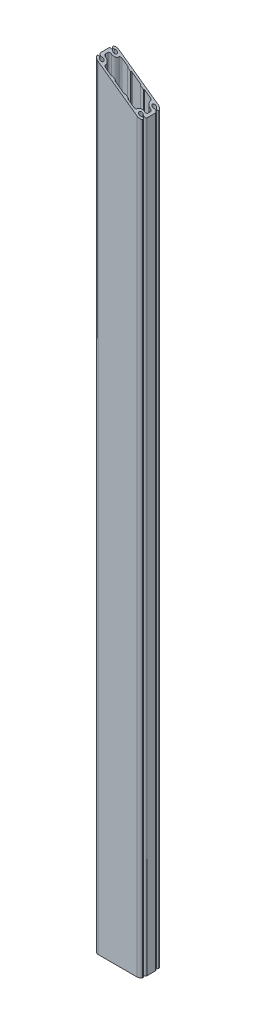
ISO-10303-21;
HEADER;
FILE_DESCRIPTION(('STEP AP214'),'2;1');
FILE_NAME('part.step','',(''),(''),'','','');
FILE_SCHEMA(('AUTOMOTIVE_DESIGN { 1 0 10303 214 1 1 1 1 }'));
ENDSEC;
DATA;
#1=APPLICATION_CONTEXT('core data for automotive mechanical design processes');
#2=APPLICATION_PROTOCOL_DEFINITION('international standard','automotive_design',2000,#1);
#3=PRODUCT_CONTEXT('',#1,'mechanical');
#4=PRODUCT('Part','Part','',(#3));
#5=PRODUCT_RELATED_PRODUCT_CATEGORY('part','',(#4));
#6=PRODUCT_DEFINITION_FORMATION('','',#4);
#7=PRODUCT_DEFINITION_CONTEXT('part definition',#1,'design');
#8=PRODUCT_DEFINITION('design','',#6,#7);
#9=PRODUCT_DEFINITION_SHAPE('','',#8);
#10=(LENGTH_UNIT() NAMED_UNIT(*) SI_UNIT(.MILLI.,.METRE.));
#11=(NAMED_UNIT(*) PLANE_ANGLE_UNIT() SI_UNIT($,.RADIAN.));
#12=(NAMED_UNIT(*) SI_UNIT($,.STERADIAN.) SOLID_ANGLE_UNIT());
#13=UNCERTAINTY_MEASURE_WITH_UNIT(LENGTH_MEASURE(1.E-05),#10,'distance_accuracy_value','');
#14=(GEOMETRIC_REPRESENTATION_CONTEXT(3) GLOBAL_UNCERTAINTY_ASSIGNED_CONTEXT((#13)) GLOBAL_UNIT_ASSIGNED_CONTEXT((#10,
#11,#12)) REPRESENTATION_CONTEXT('',''));
#15=CARTESIAN_POINT('',(0.,0.,0.));
#16=DIRECTION('',(0.,0.,1.));
#17=DIRECTION('',(1.,0.,0.));
#18=AXIS2_PLACEMENT_3D('',#15,#16,#17);
#19=CARTESIAN_POINT('',(84.6938611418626,0.,-30.5717765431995));
#20=DIRECTION('',(0.,1.,0.));
#21=DIRECTION('',(0.,0.,1.));
#22=AXIS2_PLACEMENT_3D('',#19,#20,#21);
#23=PLANE('',#22);
#24=CARTESIAN_POINT('',(84.6938611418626,0.,-30.5717765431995));
#25=DIRECTION('',(0.,1.,0.));
#26=DIRECTION('',(0.,0.,1.));
#27=AXIS2_PLACEMENT_3D('',#24,#25,#26);
#28=CIRCLE('',#27,3.99999999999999);
#29=CARTESIAN_POINT('',(81.1914378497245,0.,-28.6396711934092));
#30=VERTEX_POINT('',#29);
#31=CARTESIAN_POINT('',(88.1962844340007,0.,-32.5038818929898));
#32=VERTEX_POINT('',#31);
#33=EDGE_CURVE('E399',#30,#32,#28,.T.);
#34=ORIENTED_EDGE('',*,*,#33,.F.);
#35=CARTESIAN_POINT('',(75.5,0.,-25.5));
#36=DIRECTION('',(0.,-1.,0.));
#37=DIRECTION('',(0.,0.,1.));
#38=AXIS2_PLACEMENT_3D('',#35,#36,#37);
#39=CIRCLE('',#38,6.5);
#40=CARTESIAN_POINT('',(79.7220192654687,0.,-20.5578796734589));
#41=VERTEX_POINT('',#40);
#42=EDGE_CURVE('E388',#41,#30,#39,.T.);
#43=ORIENTED_EDGE('',*,*,#42,.F.);
#44=CARTESIAN_POINT('',(83.7691890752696,0.,-15.8204308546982));
#45=DIRECTION('',(0.,1.,0.));
#46=DIRECTION('',(0.,0.,1.));
#47=AXIS2_PLACEMENT_3D('',#44,#45,#46);
#48=CIRCLE('',#47,6.23081092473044);
#49=CARTESIAN_POINT('',(90.,0.,-15.8204308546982));
#50=VERTEX_POINT('',#49);
#51=EDGE_CURVE('E393',#50,#41,#48,.T.);
#52=ORIENTED_EDGE('',*,*,#51,.F.);
#53=DIRECTION('',(0.,0.,-1.));
#54=VECTOR('',#53,1.);
#55=CARTESIAN_POINT('',(90.,0.,15.8204308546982));
#56=LINE('',#55,#54);
#57=CARTESIAN_POINT('',(90.,0.,15.8204308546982));
#58=VERTEX_POINT('',#57);
#59=EDGE_CURVE('E447',#58,#50,#56,.T.);
#60=ORIENTED_EDGE('',*,*,#59,.F.);
#61=CARTESIAN_POINT('',(83.7691890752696,0.,15.8204308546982));
#62=DIRECTION('',(0.,1.,0.));
#63=DIRECTION('',(0.,0.,-1.));
#64=AXIS2_PLACEMENT_3D('',#61,#62,#63);
#65=CIRCLE('',#64,6.23081092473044);
#66=CARTESIAN_POINT('',(79.7220192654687,0.,20.5578796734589));
#67=VERTEX_POINT('',#66);
#68=EDGE_CURVE('E444',#67,#58,#65,.T.);
#69=ORIENTED_EDGE('',*,*,#68,.F.);
#70=CARTESIAN_POINT('',(75.5,0.,25.5));
#71=DIRECTION('',(0.,-1.,0.));
#72=DIRECTION('',(0.,0.,-1.));
#73=AXIS2_PLACEMENT_3D('',#70,#71,#72);
#74=CIRCLE('',#73,6.5);
#75=CARTESIAN_POINT('',(81.1914378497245,0.,28.6396711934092));
#76=VERTEX_POINT('',#75);
#77=EDGE_CURVE('E441',#76,#67,#74,.T.);
#78=ORIENTED_EDGE('',*,*,#77,.F.);
#79=CARTESIAN_POINT('',(84.6938611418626,0.,30.5717765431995));
#80=DIRECTION('',(0.,1.,0.));
#81=DIRECTION('',(0.,0.,-1.));
#82=AXIS2_PLACEMENT_3D('',#79,#80,#81);
#83=CIRCLE('',#82,3.99999999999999);
#84=CARTESIAN_POINT('',(88.1962844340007,0.,32.5038818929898));
#85=VERTEX_POINT('',#84);
#86=EDGE_CURVE('E438',#85,#76,#83,.T.);
#87=ORIENTED_EDGE('',*,*,#86,.F.);
#88=CARTESIAN_POINT('',(75.5,0.,25.5));
#89=DIRECTION('',(0.,1.,0.));
#90=DIRECTION('',(0.,0.,-1.));
#91=AXIS2_PLACEMENT_3D('',#88,#89,#90);
#92=CIRCLE('',#91,14.5);
#93=CARTESIAN_POINT('',(75.5,0.,40.));
#94=VERTEX_POINT('',#93);
#95=EDGE_CURVE('E435',#94,#85,#92,.T.);
#96=ORIENTED_EDGE('',*,*,#95,.F.);
#97=DIRECTION('',(1.,0.,0.));
#98=VECTOR('',#97,1.);
#99=CARTESIAN_POINT('',(75.5,0.,40.));
#100=LINE('',#99,#98);
#101=CARTESIAN_POINT('',(-75.5,0.,40.));
#102=VERTEX_POINT('',#101);
#103=EDGE_CURVE('E432',#102,#94,#100,.T.);
#104=ORIENTED_EDGE('',*,*,#103,.F.);
#105=CARTESIAN_POINT('',(-75.5,0.,25.5));
#106=DIRECTION('',(0.,1.,0.));
#107=DIRECTION('',(0.,0.,1.));
#108=AXIS2_PLACEMENT_3D('',#105,#106,#107);
#109=CIRCLE('',#108,14.5);
#110=CARTESIAN_POINT('',(-88.1962844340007,0.,32.5038818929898));
#111=VERTEX_POINT('',#110);
#112=EDGE_CURVE('E429',#111,#102,#109,.T.);
#113=ORIENTED_EDGE('',*,*,#112,.F.);
#114=CARTESIAN_POINT('',(-84.6938611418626,0.,30.5717765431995));
#115=DIRECTION('',(0.,1.,0.));
#116=DIRECTION('',(0.,0.,1.));
#117=AXIS2_PLACEMENT_3D('',#114,#115,#116);
#118=CIRCLE('',#117,3.99999999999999);
#119=CARTESIAN_POINT('',(-81.1914378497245,0.,28.6396711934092));
#120=VERTEX_POINT('',#119);
#121=EDGE_CURVE('E426',#120,#111,#118,.T.);
#122=ORIENTED_EDGE('',*,*,#121,.F.);
#123=CARTESIAN_POINT('',(-75.5,0.,25.5));
#124=DIRECTION('',(0.,-1.,0.));
#125=DIRECTION('',(0.,0.,1.));
#126=AXIS2_PLACEMENT_3D('',#123,#124,#125);
#127=CIRCLE('',#126,6.5);
#128=CARTESIAN_POINT('',(-79.7220192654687,0.,20.5578796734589));
#129=VERTEX_POINT('',#128);
#130=EDGE_CURVE('E423',#129,#120,#127,.T.);
#131=ORIENTED_EDGE('',*,*,#130,.F.);
#132=CARTESIAN_POINT('',(-83.7691890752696,0.,15.8204308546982));
#133=DIRECTION('',(0.,1.,0.));
#134=DIRECTION('',(0.,0.,1.));
#135=AXIS2_PLACEMENT_3D('',#132,#133,#134);
#136=CIRCLE('',#135,6.23081092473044);
#137=CARTESIAN_POINT('',(-90.,0.,15.8204308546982));
#138=VERTEX_POINT('',#137);
#139=EDGE_CURVE('E420',#138,#129,#136,.T.);
#140=ORIENTED_EDGE('',*,*,#139,.F.);
#141=DIRECTION('',(0.,0.,1.));
#142=VECTOR('',#141,1.);
#143=CARTESIAN_POINT('',(-90.,0.,15.8204308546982));
#144=LINE('',#143,#142);
#145=CARTESIAN_POINT('',(-90.,0.,-15.8204308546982));
#146=VERTEX_POINT('',#145);
#147=EDGE_CURVE('E418',#146,#138,#144,.T.);
#148=ORIENTED_EDGE('',*,*,#147,.F.);
#149=CARTESIAN_POINT('',(-83.7691890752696,0.,-15.8204308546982));
#150=DIRECTION('',(0.,1.,0.));
#151=DIRECTION('',(0.,0.,-1.));
#152=AXIS2_PLACEMENT_3D('',#149,#150,#151);
#153=CIRCLE('',#152,6.23081092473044);
#154=CARTESIAN_POINT('',(-79.7220192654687,0.,-20.5578796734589));
#155=VERTEX_POINT('',#154);
#156=EDGE_CURVE('E378',#155,#146,#153,.T.);
#157=ORIENTED_EDGE('',*,*,#156,.F.);
#158=CARTESIAN_POINT('',(-75.5,0.,-25.5));
#159=DIRECTION('',(0.,-1.,0.));
#160=DIRECTION('',(0.,0.,-1.));
#161=AXIS2_PLACEMENT_3D('',#158,#159,#160);
#162=CIRCLE('',#161,6.5);
#163=CARTESIAN_POINT('',(-81.1914378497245,0.,-28.6396711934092));
#164=VERTEX_POINT('',#163);
#165=EDGE_CURVE('E414',#164,#155,#162,.T.);
#166=ORIENTED_EDGE('',*,*,#165,.F.);
#167=CARTESIAN_POINT('',(-84.6938611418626,0.,-30.5717765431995));
#168=DIRECTION('',(0.,1.,0.));
#169=DIRECTION('',(0.,0.,-1.));
#170=AXIS2_PLACEMENT_3D('',#167,#168,#169);
#171=CIRCLE('',#170,3.99999999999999);
#172=CARTESIAN_POINT('',(-88.1962844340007,0.,-32.5038818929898));
#173=VERTEX_POINT('',#172);
#174=EDGE_CURVE('E411',#173,#164,#171,.T.);
#175=ORIENTED_EDGE('',*,*,#174,.F.);
#176=CARTESIAN_POINT('',(-75.5,0.,-25.5));
#177=DIRECTION('',(0.,1.,0.));
#178=DIRECTION('',(0.,0.,-1.));
#179=AXIS2_PLACEMENT_3D('',#176,#177,#178);
#180=CIRCLE('',#179,14.5);
#181=CARTESIAN_POINT('',(-75.5,0.,-40.));
#182=VERTEX_POINT('',#181);
#183=EDGE_CURVE('E408',#182,#173,#180,.T.);
#184=ORIENTED_EDGE('',*,*,#183,.F.);
#185=DIRECTION('',(-1.,0.,0.));
#186=VECTOR('',#185,1.);
#187=CARTESIAN_POINT('',(75.5,0.,-40.));
#188=LINE('',#187,#186);
#189=CARTESIAN_POINT('',(75.5,0.,-40.));
#190=VERTEX_POINT('',#189);
#191=EDGE_CURVE('E405',#190,#182,#188,.T.);
#192=ORIENTED_EDGE('',*,*,#191,.F.);
#193=CARTESIAN_POINT('',(75.5,0.,-25.5));
#194=DIRECTION('',(0.,1.,0.));
#195=DIRECTION('',(0.,0.,1.));
#196=AXIS2_PLACEMENT_3D('',#193,#194,#195);
#197=CIRCLE('',#196,14.5);
#198=EDGE_CURVE('E402',#32,#190,#197,.T.);
#199=ORIENTED_EDGE('',*,*,#198,.F.);
#200=EDGE_LOOP('',(#34,#43,#52,#60,#69,#78,#87,#96,#104,#113,#122,#131,#140,#148,#157,#166,#175,
#184,#192,#199));
#201=FACE_BOUND('',#200,.T.);
#202=CARTESIAN_POINT('',(75.5,0.,-25.5));
#203=DIRECTION('',(0.,-1.,0.));
#204=DIRECTION('',(0.,0.,1.));
#205=AXIS2_PLACEMENT_3D('',#202,#203,#204);
#206=CIRCLE('',#205,14.5);
#207=CARTESIAN_POINT('',(75.5,0.,-11.));
#208=VERTEX_POINT('',#207);
#209=CARTESIAN_POINT('',(61.,0.,-25.5));
#210=VERTEX_POINT('',#209);
#211=EDGE_CURVE('E572',#208,#210,#206,.T.);
#212=ORIENTED_EDGE('',*,*,#211,.T.);
#213=CARTESIAN_POINT('',(54.5,0.,-25.5));
#214=DIRECTION('',(0.,1.,0.));
#215=DIRECTION('',(0.,0.,1.));
#216=AXIS2_PLACEMENT_3D('',#213,#214,#215);
#217=CIRCLE('',#216,6.5);
#218=CARTESIAN_POINT('',(54.5,0.,-32.));
#219=VERTEX_POINT('',#218);
#220=EDGE_CURVE('E575',#210,#219,#217,.T.);
#221=ORIENTED_EDGE('',*,*,#220,.T.);
#222=DIRECTION('',(-1.,0.,0.));
#223=VECTOR('',#222,1.);
#224=CARTESIAN_POINT('',(32.5172988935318,0.,-32.));
#225=LINE('',#224,#223);
#226=CARTESIAN_POINT('',(32.5172988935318,0.,-32.));
#227=VERTEX_POINT('',#226);
#228=EDGE_CURVE('E578',#219,#227,#225,.T.);
#229=ORIENTED_EDGE('',*,*,#228,.T.);
#230=DIRECTION('',(-0.642787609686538,0.,0.766044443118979));
#231=VECTOR('',#230,1.);
#232=CARTESIAN_POINT('',(30.,0.,-29.));
#233=LINE('',#232,#231);
#234=CARTESIAN_POINT('',(30.,0.,-29.));
#235=VERTEX_POINT('',#234);
#236=EDGE_CURVE('E581',#227,#235,#233,.T.);
#237=ORIENTED_EDGE('',*,*,#236,.T.);
#238=DIRECTION('',(-1.,0.,0.));
#239=VECTOR('',#238,1.);
#240=CARTESIAN_POINT('',(20.,0.,-29.));
#241=LINE('',#240,#239);
#242=CARTESIAN_POINT('',(20.,0.,-29.));
#243=VERTEX_POINT('',#242);
#244=EDGE_CURVE('E584',#235,#243,#241,.T.);
#245=ORIENTED_EDGE('',*,*,#244,.T.);
#246=DIRECTION('',(-0.642787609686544,0.,-0.766044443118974));
#247=VECTOR('',#246,1.);
#248=CARTESIAN_POINT('',(20.,0.,-29.));
#249=LINE('',#248,#247);
#250=CARTESIAN_POINT('',(17.4827011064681,0.,-32.));
#251=VERTEX_POINT('',#250);
#252=EDGE_CURVE('E587',#243,#251,#249,.T.);
#253=ORIENTED_EDGE('',*,*,#252,.T.);
#254=DIRECTION('',(-1.,0.,0.));
#255=VECTOR('',#254,1.);
#256=CARTESIAN_POINT('',(-17.4827011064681,0.,-32.));
#257=LINE('',#256,#255);
#258=CARTESIAN_POINT('',(-17.4827011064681,0.,-32.));
#259=VERTEX_POINT('',#258);
#260=EDGE_CURVE('E590',#251,#259,#257,.T.);
#261=ORIENTED_EDGE('',*,*,#260,.T.);
#262=DIRECTION('',(-0.642787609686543,0.,0.766044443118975));
#263=VECTOR('',#262,1.);
#264=CARTESIAN_POINT('',(-20.,0.,-29.));
#265=LINE('',#264,#263);
#266=CARTESIAN_POINT('',(-20.,0.,-29.));
#267=VERTEX_POINT('',#266);
#268=EDGE_CURVE('E593',#259,#267,#265,.T.);
#269=ORIENTED_EDGE('',*,*,#268,.T.);
#270=DIRECTION('',(-1.,0.,0.));
#271=VECTOR('',#270,1.);
#272=CARTESIAN_POINT('',(-20.,0.,-29.));
#273=LINE('',#272,#271);
#274=CARTESIAN_POINT('',(-30.,0.,-29.));
#275=VERTEX_POINT('',#274);
#276=EDGE_CURVE('E596',#267,#275,#273,.T.);
#277=ORIENTED_EDGE('',*,*,#276,.T.);
#278=DIRECTION('',(-0.642787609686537,0.,-0.76604444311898));
#279=VECTOR('',#278,1.);
#280=CARTESIAN_POINT('',(-30.,0.,-29.));
#281=LINE('',#280,#279);
#282=CARTESIAN_POINT('',(-32.5172988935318,0.,-32.));
#283=VERTEX_POINT('',#282);
#284=EDGE_CURVE('E599',#275,#283,#281,.T.);
#285=ORIENTED_EDGE('',*,*,#284,.T.);
#286=DIRECTION('',(-1.,0.,0.));
#287=VECTOR('',#286,1.);
#288=CARTESIAN_POINT('',(-32.5172988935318,0.,-32.));
#289=LINE('',#288,#287);
#290=CARTESIAN_POINT('',(-54.5,0.,-32.));
#291=VERTEX_POINT('',#290);
#292=EDGE_CURVE('E602',#283,#291,#289,.T.);
#293=ORIENTED_EDGE('',*,*,#292,.T.);
#294=CARTESIAN_POINT('',(-54.5,0.,-25.5));
#295=DIRECTION('',(0.,1.,0.));
#296=DIRECTION('',(0.,0.,-1.));
#297=AXIS2_PLACEMENT_3D('',#294,#295,#296);
#298=CIRCLE('',#297,6.5);
#299=CARTESIAN_POINT('',(-61.,0.,-25.5));
#300=VERTEX_POINT('',#299);
#301=EDGE_CURVE('E605',#291,#300,#298,.T.);
#302=ORIENTED_EDGE('',*,*,#301,.T.);
#303=CARTESIAN_POINT('',(-75.5,0.,-25.5));
#304=DIRECTION('',(0.,-1.,0.));
#305=DIRECTION('',(0.,0.,-1.));
#306=AXIS2_PLACEMENT_3D('',#303,#304,#305);
#307=CIRCLE('',#306,14.5);
#308=CARTESIAN_POINT('',(-75.5,0.,-11.));
#309=VERTEX_POINT('',#308);
#310=EDGE_CURVE('E608',#300,#309,#307,.T.);
#311=ORIENTED_EDGE('',*,*,#310,.T.);
#312=CARTESIAN_POINT('',(-75.5,0.,-4.5));
#313=DIRECTION('',(0.,1.,0.));
#314=DIRECTION('',(0.,0.,-1.));
#315=AXIS2_PLACEMENT_3D('',#312,#313,#314);
#316=CIRCLE('',#315,6.5);
#317=CARTESIAN_POINT('',(-82.,0.,-4.5));
#318=VERTEX_POINT('',#317);
#319=EDGE_CURVE('E611',#309,#318,#316,.T.);
#320=ORIENTED_EDGE('',*,*,#319,.T.);
#321=DIRECTION('',(0.,0.,1.));
#322=VECTOR('',#321,1.);
#323=CARTESIAN_POINT('',(-82.,0.,-4.5));
#324=LINE('',#323,#322);
#325=CARTESIAN_POINT('',(-82.,0.,4.5));
#326=VERTEX_POINT('',#325);
#327=EDGE_CURVE('E614',#318,#326,#324,.T.);
#328=ORIENTED_EDGE('',*,*,#327,.T.);
#329=CARTESIAN_POINT('',(-75.5,0.,4.5));
#330=DIRECTION('',(0.,1.,0.));
#331=DIRECTION('',(0.,0.,1.));
#332=AXIS2_PLACEMENT_3D('',#329,#330,#331);
#333=CIRCLE('',#332,6.5);
#334=CARTESIAN_POINT('',(-75.5,0.,11.));
#335=VERTEX_POINT('',#334);
#336=EDGE_CURVE('E617',#326,#335,#333,.T.);
#337=ORIENTED_EDGE('',*,*,#336,.T.);
#338=CARTESIAN_POINT('',(-75.5,0.,25.5));
#339=DIRECTION('',(0.,-1.,0.));
#340=DIRECTION('',(0.,0.,1.));
#341=AXIS2_PLACEMENT_3D('',#338,#339,#340);
#342=CIRCLE('',#341,14.5);
#343=CARTESIAN_POINT('',(-61.,0.,25.5));
#344=VERTEX_POINT('',#343);
#345=EDGE_CURVE('E620',#335,#344,#342,.T.);
#346=ORIENTED_EDGE('',*,*,#345,.T.);
#347=CARTESIAN_POINT('',(-54.5,0.,25.5));
#348=DIRECTION('',(0.,1.,0.));
#349=DIRECTION('',(0.,0.,1.));
#350=AXIS2_PLACEMENT_3D('',#347,#348,#349);
#351=CIRCLE('',#350,6.5);
#352=CARTESIAN_POINT('',(-54.5,0.,32.));
#353=VERTEX_POINT('',#352);
#354=EDGE_CURVE('E623',#344,#353,#351,.T.);
#355=ORIENTED_EDGE('',*,*,#354,.T.);
#356=DIRECTION('',(1.,0.,0.));
#357=VECTOR('',#356,1.);
#358=CARTESIAN_POINT('',(-32.5172988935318,0.,32.));
#359=LINE('',#358,#357);
#360=CARTESIAN_POINT('',(-32.5172988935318,0.,32.));
#361=VERTEX_POINT('',#360);
#362=EDGE_CURVE('E626',#353,#361,#359,.T.);
#363=ORIENTED_EDGE('',*,*,#362,.T.);
#364=DIRECTION('',(0.642787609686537,0.,-0.76604444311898));
#365=VECTOR('',#364,1.);
#366=CARTESIAN_POINT('',(-30.,0.,29.));
#367=LINE('',#366,#365);
#368=CARTESIAN_POINT('',(-30.,0.,29.));
#369=VERTEX_POINT('',#368);
#370=EDGE_CURVE('E629',#361,#369,#367,.T.);
#371=ORIENTED_EDGE('',*,*,#370,.T.);
#372=DIRECTION('',(1.,0.,0.));
#373=VECTOR('',#372,1.);
#374=CARTESIAN_POINT('',(-20.,0.,29.));
#375=LINE('',#374,#373);
#376=CARTESIAN_POINT('',(-20.,0.,29.));
#377=VERTEX_POINT('',#376);
#378=EDGE_CURVE('E632',#369,#377,#375,.T.);
#379=ORIENTED_EDGE('',*,*,#378,.T.);
#380=DIRECTION('',(0.642787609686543,0.,0.766044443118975));
#381=VECTOR('',#380,1.);
#382=CARTESIAN_POINT('',(-20.,0.,29.));
#383=LINE('',#382,#381);
#384=CARTESIAN_POINT('',(-17.4827011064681,0.,32.));
#385=VERTEX_POINT('',#384);
#386=EDGE_CURVE('E635',#377,#385,#383,.T.);
#387=ORIENTED_EDGE('',*,*,#386,.T.);
#388=DIRECTION('',(1.,0.,0.));
#389=VECTOR('',#388,1.);
#390=CARTESIAN_POINT('',(-17.4827011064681,0.,32.));
#391=LINE('',#390,#389);
#392=CARTESIAN_POINT('',(17.4827011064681,0.,32.));
#393=VERTEX_POINT('',#392);
#394=EDGE_CURVE('E638',#385,#393,#391,.T.);
#395=ORIENTED_EDGE('',*,*,#394,.T.);
#396=DIRECTION('',(0.642787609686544,0.,-0.766044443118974));
#397=VECTOR('',#396,1.);
#398=CARTESIAN_POINT('',(20.,0.,29.));
#399=LINE('',#398,#397);
#400=CARTESIAN_POINT('',(20.,0.,29.));
#401=VERTEX_POINT('',#400);
#402=EDGE_CURVE('E641',#393,#401,#399,.T.);
#403=ORIENTED_EDGE('',*,*,#402,.T.);
#404=DIRECTION('',(1.,0.,0.));
#405=VECTOR('',#404,1.);
#406=CARTESIAN_POINT('',(20.,0.,29.));
#407=LINE('',#406,#405);
#408=CARTESIAN_POINT('',(30.,0.,29.));
#409=VERTEX_POINT('',#408);
#410=EDGE_CURVE('E644',#401,#409,#407,.T.);
#411=ORIENTED_EDGE('',*,*,#410,.T.);
#412=DIRECTION('',(0.642787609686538,0.,0.766044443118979));
#413=VECTOR('',#412,1.);
#414=CARTESIAN_POINT('',(30.,0.,29.));
#415=LINE('',#414,#413);
#416=CARTESIAN_POINT('',(32.5172988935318,0.,32.));
#417=VERTEX_POINT('',#416);
#418=EDGE_CURVE('E647',#409,#417,#415,.T.);
#419=ORIENTED_EDGE('',*,*,#418,.T.);
#420=DIRECTION('',(1.,0.,0.));
#421=VECTOR('',#420,1.);
#422=CARTESIAN_POINT('',(32.5172988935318,0.,32.));
#423=LINE('',#422,#421);
#424=CARTESIAN_POINT('',(54.5,0.,32.));
#425=VERTEX_POINT('',#424);
#426=EDGE_CURVE('E650',#417,#425,#423,.T.);
#427=ORIENTED_EDGE('',*,*,#426,.T.);
#428=CARTESIAN_POINT('',(54.5,0.,25.5));
#429=DIRECTION('',(0.,1.,0.));
#430=DIRECTION('',(0.,0.,-1.));
#431=AXIS2_PLACEMENT_3D('',#428,#429,#430);
#432=CIRCLE('',#431,6.5);
#433=CARTESIAN_POINT('',(61.,0.,25.5));
#434=VERTEX_POINT('',#433);
#435=EDGE_CURVE('E653',#425,#434,#432,.T.);
#436=ORIENTED_EDGE('',*,*,#435,.T.);
#437=CARTESIAN_POINT('',(75.5,0.,25.5));
#438=DIRECTION('',(0.,-1.,0.));
#439=DIRECTION('',(0.,0.,-1.));
#440=AXIS2_PLACEMENT_3D('',#437,#438,#439);
#441=CIRCLE('',#440,14.5);
#442=CARTESIAN_POINT('',(75.5,0.,11.));
#443=VERTEX_POINT('',#442);
#444=EDGE_CURVE('E656',#434,#443,#441,.T.);
#445=ORIENTED_EDGE('',*,*,#444,.T.);
#446=CARTESIAN_POINT('',(75.5,0.,4.5));
#447=DIRECTION('',(0.,1.,0.));
#448=DIRECTION('',(0.,0.,-1.));
#449=AXIS2_PLACEMENT_3D('',#446,#447,#448);
#450=CIRCLE('',#449,6.5);
#451=CARTESIAN_POINT('',(82.,0.,4.5));
#452=VERTEX_POINT('',#451);
#453=EDGE_CURVE('E659',#443,#452,#450,.T.);
#454=ORIENTED_EDGE('',*,*,#453,.T.);
#455=DIRECTION('',(0.,0.,-1.));
#456=VECTOR('',#455,1.);
#457=CARTESIAN_POINT('',(82.,0.,-4.5));
#458=LINE('',#457,#456);
#459=CARTESIAN_POINT('',(82.,0.,-4.5));
#460=VERTEX_POINT('',#459);
#461=EDGE_CURVE('E662',#452,#460,#458,.T.);
#462=ORIENTED_EDGE('',*,*,#461,.T.);
#463=CARTESIAN_POINT('',(75.5,0.,-4.5));
#464=DIRECTION('',(0.,1.,0.));
#465=DIRECTION('',(0.,0.,1.));
#466=AXIS2_PLACEMENT_3D('',#463,#464,#465);
#467=CIRCLE('',#466,6.5);
#468=EDGE_CURVE('E665',#460,#208,#467,.T.);
#469=ORIENTED_EDGE('',*,*,#468,.T.);
#470=EDGE_LOOP('',(#212,#221,#229,#237,#245,#253,#261,#269,#277,#285,#293,#302,#311,#320,#328,
#337,#346,#355,#363,#371,#379,#387,#395,#403,#411,#419,#427,#436,#445,#454,#462,#469));
#471=FACE_BOUND('',#470,.T.);
#472=ADVANCED_FACE('F36',(#201,#471),#23,.F.);
#473=CARTESIAN_POINT('',(84.6938611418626,3000.,-30.5717765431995));
#474=DIRECTION('',(0.,-1.,0.));
#475=DIRECTION('',(0.,0.,-1.));
#476=AXIS2_PLACEMENT_3D('',#473,#474,#475);
#477=CYLINDRICAL_SURFACE('',#476,3.99999999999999);
#478=DIRECTION('',(0.,-1.,0.));
#479=VECTOR('',#478,1.);
#480=CARTESIAN_POINT('',(88.1962844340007,3000.,-32.5038818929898));
#481=LINE('',#480,#479);
#482=CARTESIAN_POINT('',(88.1962844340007,2873.17516532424,-32.5038818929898));
#483=VERTEX_POINT('',#482);
#484=EDGE_CURVE('E44',#483,#32,#481,.T.);
#485=ORIENTED_EDGE('',*,*,#484,.F.);
#486=CARTESIAN_POINT('',(84.6938611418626,2875.66788988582,-30.5717765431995));
#487=DIRECTION('',(-0.579850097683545,-0.814723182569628,0.));
#488=DIRECTION('',(0.814723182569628,-0.579850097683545,0.));
#489=AXIS2_PLACEMENT_3D('',#486,#487,#488);
#490=ELLIPSE('',#489,4.90964303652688,3.99999999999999);
#491=CARTESIAN_POINT('',(81.1914378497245,2878.16061444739,-28.6396711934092));
#492=VERTEX_POINT('',#491);
#493=EDGE_CURVE('E498',#483,#492,#490,.T.);
#494=ORIENTED_EDGE('',*,*,#493,.T.);
#495=DIRECTION('',(0.,-1.,0.));
#496=VECTOR('',#495,1.);
#497=CARTESIAN_POINT('',(81.1914378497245,3000.,-28.6396711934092));
#498=LINE('',#497,#496);
#499=EDGE_CURVE('E387',#492,#30,#498,.T.);
#500=ORIENTED_EDGE('',*,*,#499,.T.);
#501=ORIENTED_EDGE('',*,*,#33,.T.);
#502=EDGE_LOOP('',(#485,#494,#500,#501));
#503=FACE_BOUND('',#502,.T.);
#504=ADVANCED_FACE('F38',(#503),#477,.T.);
#505=CARTESIAN_POINT('',(75.5,3000.,-25.5));
#506=DIRECTION('',(0.,-1.,0.));
#507=DIRECTION('',(0.,0.,-1.));
#508=AXIS2_PLACEMENT_3D('',#505,#506,#507);
#509=CYLINDRICAL_SURFACE('',#508,14.5);
#510=DIRECTION('',(0.,-1.,0.));
#511=VECTOR('',#510,1.);
#512=CARTESIAN_POINT('',(75.5,3000.,-40.));
#513=LINE('',#512,#511);
#514=CARTESIAN_POINT('',(75.5,2882.21129185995,-40.));
#515=VERTEX_POINT('',#514);
#516=EDGE_CURVE('E481',#515,#190,#513,.T.);
#517=ORIENTED_EDGE('',*,*,#516,.F.);
#518=CARTESIAN_POINT('',(75.5,2882.21129185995,-25.5));
#519=DIRECTION('',(-0.579850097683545,-0.814723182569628,0.));
#520=DIRECTION('',(0.814723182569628,-0.579850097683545,0.));
#521=AXIS2_PLACEMENT_3D('',#518,#519,#520);
#522=ELLIPSE('',#521,17.79745600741,14.5);
#523=EDGE_CURVE('E489',#515,#483,#522,.T.);
#524=ORIENTED_EDGE('',*,*,#523,.T.);
#525=ORIENTED_EDGE('',*,*,#484,.T.);
#526=ORIENTED_EDGE('',*,*,#198,.T.);
#527=EDGE_LOOP('',(#517,#524,#525,#526));
#528=FACE_BOUND('',#527,.T.);
#529=ADVANCED_FACE('F487',(#528),#509,.T.);
#530=CARTESIAN_POINT('',(75.5,3000.,-40.));
#531=DIRECTION('',(0.,0.,1.));
#532=DIRECTION('',(1.,0.,0.));
#533=AXIS2_PLACEMENT_3D('',#530,#531,#532);
#534=PLANE('',#533);
#535=DIRECTION('',(0.,-1.,0.));
#536=VECTOR('',#535,1.);
#537=CARTESIAN_POINT('',(-75.5,3000.,-40.));
#538=LINE('',#537,#536);
#539=CARTESIAN_POINT('',(-75.5,2989.68014339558,-40.));
#540=VERTEX_POINT('',#539);
#541=EDGE_CURVE('E479',#540,#182,#538,.T.);
#542=ORIENTED_EDGE('',*,*,#541,.F.);
#543=DIRECTION('',(0.814723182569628,-0.579850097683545,0.));
#544=VECTOR('',#543,1.);
#545=CARTESIAN_POINT('',(90.,2871.89143525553,-40.));
#546=LINE('',#545,#544);
#547=EDGE_CURVE('E754',#540,#515,#546,.T.);
#548=ORIENTED_EDGE('',*,*,#547,.T.);
#549=ORIENTED_EDGE('',*,*,#516,.T.);
#550=ORIENTED_EDGE('',*,*,#191,.T.);
#551=EDGE_LOOP('',(#542,#548,#549,#550));
#552=FACE_BOUND('',#551,.T.);
#553=ADVANCED_FACE('F829',(#552),#534,.F.);
#554=CARTESIAN_POINT('',(-75.5,3000.,-25.5));
#555=DIRECTION('',(0.,-1.,0.));
#556=DIRECTION('',(0.,0.,-1.));
#557=AXIS2_PLACEMENT_3D('',#554,#555,#556);
#558=CYLINDRICAL_SURFACE('',#557,14.5);
#559=DIRECTION('',(0.,-1.,0.));
#560=VECTOR('',#559,1.);
#561=CARTESIAN_POINT('',(-88.1962844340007,3000.,-32.5038818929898));
#562=LINE('',#561,#560);
#563=CARTESIAN_POINT('',(-88.1962844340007,2998.71626993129,-32.5038818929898));
#564=VERTEX_POINT('',#563);
#565=EDGE_CURVE('E477',#564,#173,#562,.T.);
#566=ORIENTED_EDGE('',*,*,#565,.F.);
#567=CARTESIAN_POINT('',(-75.5,2989.68014339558,-25.5));
#568=DIRECTION('',(-0.579850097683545,-0.814723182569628,0.));
#569=DIRECTION('',(0.814723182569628,-0.579850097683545,0.));
#570=AXIS2_PLACEMENT_3D('',#567,#568,#569);
#571=ELLIPSE('',#570,17.79745600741,14.5);
#572=EDGE_CURVE('E569',#564,#540,#571,.T.);
#573=ORIENTED_EDGE('',*,*,#572,.T.);
#574=ORIENTED_EDGE('',*,*,#541,.T.);
#575=ORIENTED_EDGE('',*,*,#183,.T.);
#576=EDGE_LOOP('',(#566,#573,#574,#575));
#577=FACE_BOUND('',#576,.T.);
#578=ADVANCED_FACE('F832',(#577),#558,.T.);
#579=CARTESIAN_POINT('',(-84.6938611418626,3000.,-30.5717765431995));
#580=DIRECTION('',(0.,-1.,0.));
#581=DIRECTION('',(0.,0.,-1.));
#582=AXIS2_PLACEMENT_3D('',#579,#580,#581);
#583=CYLINDRICAL_SURFACE('',#582,3.99999999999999);
#584=DIRECTION('',(0.,-1.,0.));
#585=VECTOR('',#584,1.);
#586=CARTESIAN_POINT('',(-81.1914378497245,3000.,-28.6396711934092));
#587=LINE('',#586,#585);
#588=CARTESIAN_POINT('',(-81.1914378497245,2993.73082080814,-28.6396711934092));
#589=VERTEX_POINT('',#588);
#590=EDGE_CURVE('E475',#589,#164,#587,.T.);
#591=ORIENTED_EDGE('',*,*,#590,.F.);
#592=CARTESIAN_POINT('',(-84.6938611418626,2996.22354536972,-30.5717765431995));
#593=DIRECTION('',(-0.579850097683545,-0.814723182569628,0.));
#594=DIRECTION('',(0.814723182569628,-0.579850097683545,0.));
#595=AXIS2_PLACEMENT_3D('',#592,#593,#594);
#596=ELLIPSE('',#595,4.90964303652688,3.99999999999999);
#597=EDGE_CURVE('E566',#589,#564,#596,.T.);
#598=ORIENTED_EDGE('',*,*,#597,.T.);
#599=ORIENTED_EDGE('',*,*,#565,.T.);
#600=ORIENTED_EDGE('',*,*,#174,.T.);
#601=EDGE_LOOP('',(#591,#598,#599,#600));
#602=FACE_BOUND('',#601,.T.);
#603=ADVANCED_FACE('F836',(#602),#583,.T.);
#604=CARTESIAN_POINT('',(-75.5,3000.,-25.5));
#605=DIRECTION('',(0.,-1.,0.));
#606=DIRECTION('',(0.,0.,-1.));
#607=AXIS2_PLACEMENT_3D('',#604,#605,#606);
#608=CYLINDRICAL_SURFACE('',#607,6.5);
#609=DIRECTION('',(0.,-1.,0.));
#610=VECTOR('',#609,1.);
#611=CARTESIAN_POINT('',(-79.7220192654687,3000.,-20.5578796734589));
#612=LINE('',#611,#610);
#613=CARTESIAN_POINT('',(-79.7220192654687,2992.6850146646,-20.5578796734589));
#614=VERTEX_POINT('',#613);
#615=EDGE_CURVE('E381',#614,#155,#612,.T.);
#616=ORIENTED_EDGE('',*,*,#615,.F.);
#617=CARTESIAN_POINT('',(-75.5,2989.68014339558,-25.5));
#618=DIRECTION('',(-0.579850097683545,-0.814723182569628,0.));
#619=DIRECTION('',(0.814723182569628,-0.579850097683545,0.));
#620=AXIS2_PLACEMENT_3D('',#617,#618,#619);
#621=ELLIPSE('',#620,7.9781699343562,6.5);
#622=EDGE_CURVE('E369',#614,#589,#621,.F.);
#623=ORIENTED_EDGE('',*,*,#622,.T.);
#624=ORIENTED_EDGE('',*,*,#590,.T.);
#625=ORIENTED_EDGE('',*,*,#165,.T.);
#626=EDGE_LOOP('',(#616,#623,#624,#625));
#627=FACE_BOUND('',#626,.T.);
#628=ADVANCED_FACE('F839',(#627),#608,.F.);
#629=CARTESIAN_POINT('',(-83.7691890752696,3000.,-15.8204308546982));
#630=DIRECTION('',(0.,-1.,0.));
#631=DIRECTION('',(0.,0.,-1.));
#632=AXIS2_PLACEMENT_3D('',#629,#630,#631);
#633=CYLINDRICAL_SURFACE('',#632,6.23081092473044);
#634=DIRECTION('',(0.,-1.,0.));
#635=VECTOR('',#634,1.);
#636=CARTESIAN_POINT('',(-90.,3000.,-15.8204308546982));
#637=LINE('',#636,#635);
#638=CARTESIAN_POINT('',(-90.,3000.,-15.8204308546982));
#639=VERTEX_POINT('',#638);
#640=EDGE_CURVE('E375',#639,#146,#637,.T.);
#641=ORIENTED_EDGE('',*,*,#640,.F.);
#642=CARTESIAN_POINT('',(-83.7691890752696,2995.56544308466,-15.8204308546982));
#643=DIRECTION('',(-0.579850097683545,-0.814723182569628,0.));
#644=DIRECTION('',(0.814723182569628,-0.579850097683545,0.));
#645=AXIS2_PLACEMENT_3D('',#642,#643,#644);
#646=ELLIPSE('',#645,7.64776436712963,6.23081092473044);
#647=EDGE_CURVE('E362',#639,#614,#646,.T.);
#648=ORIENTED_EDGE('',*,*,#647,.T.);
#649=ORIENTED_EDGE('',*,*,#615,.T.);
#650=ORIENTED_EDGE('',*,*,#156,.T.);
#651=EDGE_LOOP('',(#641,#648,#649,#650));
#652=FACE_BOUND('',#651,.T.);
#653=ADVANCED_FACE('F376',(#652),#633,.T.);
#654=CARTESIAN_POINT('',(-90.,3000.,15.8204308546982));
#655=DIRECTION('',(1.,0.,0.));
#656=DIRECTION('',(0.,0.,-1.));
#657=AXIS2_PLACEMENT_3D('',#654,#655,#656);
#658=PLANE('',#657);
#659=ORIENTED_EDGE('',*,*,#147,.T.);
#660=DIRECTION('',(0.,-1.,0.));
#661=VECTOR('',#660,1.);
#662=CARTESIAN_POINT('',(-90.,3000.,15.8204308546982));
#663=LINE('',#662,#661);
#664=CARTESIAN_POINT('',(-90.,3000.,15.8204308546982));
#665=VERTEX_POINT('',#664);
#666=EDGE_CURVE('E382',#665,#138,#663,.T.);
#667=ORIENTED_EDGE('',*,*,#666,.F.);
#668=DIRECTION('',(0.,0.,1.));
#669=VECTOR('',#668,1.);
#670=CARTESIAN_POINT('',(-90.,3000.,15.8204308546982));
#671=LINE('',#670,#669);
#672=EDGE_CURVE('E366',#639,#665,#671,.T.);
#673=ORIENTED_EDGE('',*,*,#672,.F.);
#674=ORIENTED_EDGE('',*,*,#640,.T.);
#675=EDGE_LOOP('',(#659,#667,#673,#674));
#676=FACE_BOUND('',#675,.T.);
#677=ADVANCED_FACE('F385',(#676),#658,.F.);
#678=CARTESIAN_POINT('',(-83.7691890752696,3000.,15.8204308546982));
#679=DIRECTION('',(0.,-1.,0.));
#680=DIRECTION('',(0.,0.,-1.));
#681=AXIS2_PLACEMENT_3D('',#678,#679,#680);
#682=CYLINDRICAL_SURFACE('',#681,6.23081092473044);
#683=DIRECTION('',(0.,-1.,0.));
#684=VECTOR('',#683,1.);
#685=CARTESIAN_POINT('',(-79.7220192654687,3000.,20.5578796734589));
#686=LINE('',#685,#684);
#687=CARTESIAN_POINT('',(-79.7220192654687,2992.6850146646,20.5578796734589));
#688=VERTEX_POINT('',#687);
#689=EDGE_CURVE('E471',#688,#129,#686,.T.);
#690=ORIENTED_EDGE('',*,*,#689,.F.);
#691=CARTESIAN_POINT('',(-83.7691890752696,2995.56544308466,15.8204308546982));
#692=DIRECTION('',(-0.579850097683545,-0.814723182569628,0.));
#693=DIRECTION('',(0.814723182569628,-0.579850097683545,0.));
#694=AXIS2_PLACEMENT_3D('',#691,#692,#693);
#695=ELLIPSE('',#694,7.64776436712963,6.23081092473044);
#696=EDGE_CURVE('E372',#688,#665,#695,.T.);
#697=ORIENTED_EDGE('',*,*,#696,.T.);
#698=ORIENTED_EDGE('',*,*,#666,.T.);
#699=ORIENTED_EDGE('',*,*,#139,.T.);
#700=EDGE_LOOP('',(#690,#697,#698,#699));
#701=FACE_BOUND('',#700,.T.);
#702=ADVANCED_FACE('F559',(#701),#682,.T.);
#703=CARTESIAN_POINT('',(-75.5,3000.,25.5));
#704=DIRECTION('',(0.,-1.,0.));
#705=DIRECTION('',(0.,0.,-1.));
#706=AXIS2_PLACEMENT_3D('',#703,#704,#705);
#707=CYLINDRICAL_SURFACE('',#706,6.5);
#708=DIRECTION('',(0.,-1.,0.));
#709=VECTOR('',#708,1.);
#710=CARTESIAN_POINT('',(-81.1914378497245,3000.,28.6396711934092));
#711=LINE('',#710,#709);
#712=CARTESIAN_POINT('',(-81.1914378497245,2993.73082080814,28.6396711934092));
#713=VERTEX_POINT('',#712);
#714=EDGE_CURVE('E469',#713,#120,#711,.T.);
#715=ORIENTED_EDGE('',*,*,#714,.F.);
#716=CARTESIAN_POINT('',(-75.5,2989.68014339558,25.5));
#717=DIRECTION('',(-0.579850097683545,-0.814723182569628,0.));
#718=DIRECTION('',(0.814723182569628,-0.579850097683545,0.));
#719=AXIS2_PLACEMENT_3D('',#716,#717,#718);
#720=ELLIPSE('',#719,7.9781699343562,6.5);
#721=EDGE_CURVE('E557',#713,#688,#720,.F.);
#722=ORIENTED_EDGE('',*,*,#721,.T.);
#723=ORIENTED_EDGE('',*,*,#689,.T.);
#724=ORIENTED_EDGE('',*,*,#130,.T.);
#725=EDGE_LOOP('',(#715,#722,#723,#724));
#726=FACE_BOUND('',#725,.T.);
#727=ADVANCED_FACE('F554',(#726),#707,.F.);
#728=CARTESIAN_POINT('',(-84.6938611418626,3000.,30.5717765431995));
#729=DIRECTION('',(0.,-1.,0.));
#730=DIRECTION('',(0.,0.,-1.));
#731=AXIS2_PLACEMENT_3D('',#728,#729,#730);
#732=CYLINDRICAL_SURFACE('',#731,3.99999999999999);
#733=DIRECTION('',(0.,-1.,0.));
#734=VECTOR('',#733,1.);
#735=CARTESIAN_POINT('',(-88.1962844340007,3000.,32.5038818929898));
#736=LINE('',#735,#734);
#737=CARTESIAN_POINT('',(-88.1962844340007,2998.71626993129,32.5038818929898));
#738=VERTEX_POINT('',#737);
#739=EDGE_CURVE('E467',#738,#111,#736,.T.);
#740=ORIENTED_EDGE('',*,*,#739,.F.);
#741=CARTESIAN_POINT('',(-84.6938611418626,2996.22354536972,30.5717765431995));
#742=DIRECTION('',(-0.579850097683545,-0.814723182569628,0.));
#743=DIRECTION('',(0.814723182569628,-0.579850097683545,0.));
#744=AXIS2_PLACEMENT_3D('',#741,#742,#743);
#745=ELLIPSE('',#744,4.90964303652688,3.99999999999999);
#746=EDGE_CURVE('E561',#738,#713,#745,.T.);
#747=ORIENTED_EDGE('',*,*,#746,.T.);
#748=ORIENTED_EDGE('',*,*,#714,.T.);
#749=ORIENTED_EDGE('',*,*,#121,.T.);
#750=EDGE_LOOP('',(#740,#747,#748,#749));
#751=FACE_BOUND('',#750,.T.);
#752=ADVANCED_FACE('F549',(#751),#732,.T.);
#753=CARTESIAN_POINT('',(-75.5,3000.,25.5));
#754=DIRECTION('',(0.,-1.,0.));
#755=DIRECTION('',(0.,0.,-1.));
#756=AXIS2_PLACEMENT_3D('',#753,#754,#755);
#757=CYLINDRICAL_SURFACE('',#756,14.5);
#758=DIRECTION('',(0.,-1.,0.));
#759=VECTOR('',#758,1.);
#760=CARTESIAN_POINT('',(-75.5,3000.,40.));
#761=LINE('',#760,#759);
#762=CARTESIAN_POINT('',(-75.5000000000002,2989.68014339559,40.));
#763=VERTEX_POINT('',#762);
#764=EDGE_CURVE('E465',#763,#102,#761,.T.);
#765=ORIENTED_EDGE('',*,*,#764,.F.);
#766=CARTESIAN_POINT('',(-75.5,2989.68014339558,25.5));
#767=DIRECTION('',(-0.579850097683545,-0.814723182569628,0.));
#768=DIRECTION('',(0.814723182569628,-0.579850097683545,0.));
#769=AXIS2_PLACEMENT_3D('',#766,#767,#768);
#770=ELLIPSE('',#769,17.79745600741,14.5);
#771=EDGE_CURVE('E546',#763,#738,#770,.T.);
#772=ORIENTED_EDGE('',*,*,#771,.T.);
#773=ORIENTED_EDGE('',*,*,#739,.T.);
#774=ORIENTED_EDGE('',*,*,#112,.T.);
#775=EDGE_LOOP('',(#765,#772,#773,#774));
#776=FACE_BOUND('',#775,.T.);
#777=ADVANCED_FACE('F544',(#776),#757,.T.);
#778=CARTESIAN_POINT('',(75.5,3000.,40.));
#779=DIRECTION('',(0.,0.,-1.));
#780=DIRECTION('',(-1.,0.,0.));
#781=AXIS2_PLACEMENT_3D('',#778,#779,#780);
#782=PLANE('',#781);
#783=DIRECTION('',(0.,-1.,0.));
#784=VECTOR('',#783,1.);
#785=CARTESIAN_POINT('',(75.5,3000.,40.));
#786=LINE('',#785,#784);
#787=CARTESIAN_POINT('',(75.5,2882.21129185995,40.));
#788=VERTEX_POINT('',#787);
#789=EDGE_CURVE('E463',#788,#94,#786,.T.);
#790=ORIENTED_EDGE('',*,*,#789,.F.);
#791=DIRECTION('',(0.814723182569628,-0.579850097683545,0.));
#792=VECTOR('',#791,1.);
#793=CARTESIAN_POINT('',(90.,2871.89143525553,40.));
#794=LINE('',#793,#792);
#795=EDGE_CURVE('E541',#763,#788,#794,.T.);
#796=ORIENTED_EDGE('',*,*,#795,.F.);
#797=ORIENTED_EDGE('',*,*,#764,.T.);
#798=ORIENTED_EDGE('',*,*,#103,.T.);
#799=EDGE_LOOP('',(#790,#796,#797,#798));
#800=FACE_BOUND('',#799,.T.);
#801=ADVANCED_FACE('F538',(#800),#782,.F.);
#802=CARTESIAN_POINT('',(75.5,3000.,25.5));
#803=DIRECTION('',(0.,-1.,0.));
#804=DIRECTION('',(0.,0.,-1.));
#805=AXIS2_PLACEMENT_3D('',#802,#803,#804);
#806=CYLINDRICAL_SURFACE('',#805,14.5);
#807=DIRECTION('',(0.,-1.,0.));
#808=VECTOR('',#807,1.);
#809=CARTESIAN_POINT('',(88.1962844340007,3000.,32.5038818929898));
#810=LINE('',#809,#808);
#811=CARTESIAN_POINT('',(88.1962844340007,2873.17516532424,32.5038818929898));
#812=VERTEX_POINT('',#811);
#813=EDGE_CURVE('E461',#812,#85,#810,.T.);
#814=ORIENTED_EDGE('',*,*,#813,.F.);
#815=CARTESIAN_POINT('',(75.5,2882.21129185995,25.5));
#816=DIRECTION('',(-0.579850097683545,-0.814723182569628,0.));
#817=DIRECTION('',(0.814723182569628,-0.579850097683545,0.));
#818=AXIS2_PLACEMENT_3D('',#815,#816,#817);
#819=ELLIPSE('',#818,17.79745600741,14.5);
#820=EDGE_CURVE('E823',#812,#788,#819,.T.);
#821=ORIENTED_EDGE('',*,*,#820,.T.);
#822=ORIENTED_EDGE('',*,*,#789,.T.);
#823=ORIENTED_EDGE('',*,*,#95,.T.);
#824=EDGE_LOOP('',(#814,#821,#822,#823));
#825=FACE_BOUND('',#824,.T.);
#826=ADVANCED_FACE('F532',(#825),#806,.T.);
#827=CARTESIAN_POINT('',(84.6938611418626,3000.,30.5717765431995));
#828=DIRECTION('',(0.,-1.,0.));
#829=DIRECTION('',(0.,0.,-1.));
#830=AXIS2_PLACEMENT_3D('',#827,#828,#829);
#831=CYLINDRICAL_SURFACE('',#830,3.99999999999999);
#832=DIRECTION('',(0.,-1.,0.));
#833=VECTOR('',#832,1.);
#834=CARTESIAN_POINT('',(81.1914378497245,3000.,28.6396711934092));
#835=LINE('',#834,#833);
#836=CARTESIAN_POINT('',(81.1914378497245,2878.16061444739,28.6396711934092));
#837=VERTEX_POINT('',#836);
#838=EDGE_CURVE('E459',#837,#76,#835,.T.);
#839=ORIENTED_EDGE('',*,*,#838,.F.);
#840=CARTESIAN_POINT('',(84.6938611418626,2875.66788988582,30.5717765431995));
#841=DIRECTION('',(-0.579850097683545,-0.814723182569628,0.));
#842=DIRECTION('',(0.814723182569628,-0.579850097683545,0.));
#843=AXIS2_PLACEMENT_3D('',#840,#841,#842);
#844=ELLIPSE('',#843,4.90964303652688,3.99999999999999);
#845=EDGE_CURVE('E529',#837,#812,#844,.T.);
#846=ORIENTED_EDGE('',*,*,#845,.T.);
#847=ORIENTED_EDGE('',*,*,#813,.T.);
#848=ORIENTED_EDGE('',*,*,#86,.T.);
#849=EDGE_LOOP('',(#839,#846,#847,#848));
#850=FACE_BOUND('',#849,.T.);
#851=ADVANCED_FACE('F527',(#850),#831,.T.);
#852=CARTESIAN_POINT('',(75.5,3000.,25.5));
#853=DIRECTION('',(0.,-1.,0.));
#854=DIRECTION('',(0.,0.,-1.));
#855=AXIS2_PLACEMENT_3D('',#852,#853,#854);
#856=CYLINDRICAL_SURFACE('',#855,6.5);
#857=DIRECTION('',(0.,-1.,0.));
#858=VECTOR('',#857,1.);
#859=CARTESIAN_POINT('',(79.7220192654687,3000.,20.5578796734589));
#860=LINE('',#859,#858);
#861=CARTESIAN_POINT('',(79.7220192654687,2879.20642059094,20.5578796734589));
#862=VERTEX_POINT('',#861);
#863=EDGE_CURVE('E457',#862,#67,#860,.T.);
#864=ORIENTED_EDGE('',*,*,#863,.F.);
#865=CARTESIAN_POINT('',(75.5,2882.21129185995,25.5));
#866=DIRECTION('',(-0.579850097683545,-0.814723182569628,0.));
#867=DIRECTION('',(0.814723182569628,-0.579850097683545,0.));
#868=AXIS2_PLACEMENT_3D('',#865,#866,#867);
#869=ELLIPSE('',#868,7.9781699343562,6.5);
#870=EDGE_CURVE('E524',#862,#837,#869,.F.);
#871=ORIENTED_EDGE('',*,*,#870,.T.);
#872=ORIENTED_EDGE('',*,*,#838,.T.);
#873=ORIENTED_EDGE('',*,*,#77,.T.);
#874=EDGE_LOOP('',(#864,#871,#872,#873));
#875=FACE_BOUND('',#874,.T.);
#876=ADVANCED_FACE('F521',(#875),#856,.F.);
#877=CARTESIAN_POINT('',(83.7691890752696,3000.,15.8204308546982));
#878=DIRECTION('',(0.,-1.,0.));
#879=DIRECTION('',(0.,0.,-1.));
#880=AXIS2_PLACEMENT_3D('',#877,#878,#879);
#881=CYLINDRICAL_SURFACE('',#880,6.23081092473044);
#882=DIRECTION('',(0.,-1.,0.));
#883=VECTOR('',#882,1.);
#884=CARTESIAN_POINT('',(90.,3000.,15.8204308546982));
#885=LINE('',#884,#883);
#886=CARTESIAN_POINT('',(90.,2871.89143525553,15.8204308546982));
#887=VERTEX_POINT('',#886);
#888=EDGE_CURVE('E455',#887,#58,#885,.T.);
#889=ORIENTED_EDGE('',*,*,#888,.F.);
#890=CARTESIAN_POINT('',(83.7691890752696,2876.32599217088,15.8204308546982));
#891=DIRECTION('',(-0.579850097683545,-0.814723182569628,0.));
#892=DIRECTION('',(0.814723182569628,-0.579850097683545,0.));
#893=AXIS2_PLACEMENT_3D('',#890,#891,#892);
#894=ELLIPSE('',#893,7.64776436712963,6.23081092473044);
#895=EDGE_CURVE('E819',#887,#862,#894,.T.);
#896=ORIENTED_EDGE('',*,*,#895,.T.);
#897=ORIENTED_EDGE('',*,*,#863,.T.);
#898=ORIENTED_EDGE('',*,*,#68,.T.);
#899=EDGE_LOOP('',(#889,#896,#897,#898));
#900=FACE_BOUND('',#899,.T.);
#901=ADVANCED_FACE('F515',(#900),#881,.T.);
#902=CARTESIAN_POINT('',(90.,3000.,15.8204308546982));
#903=DIRECTION('',(-1.,0.,0.));
#904=DIRECTION('',(0.,0.,1.));
#905=AXIS2_PLACEMENT_3D('',#902,#903,#904);
#906=PLANE('',#905);
#907=DIRECTION('',(0.,-1.,0.));
#908=VECTOR('',#907,1.);
#909=CARTESIAN_POINT('',(90.,3000.,-15.8204308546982));
#910=LINE('',#909,#908);
#911=CARTESIAN_POINT('',(90.,2871.89143525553,-15.8204308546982));
#912=VERTEX_POINT('',#911);
#913=EDGE_CURVE('E453',#912,#50,#910,.T.);
#914=ORIENTED_EDGE('',*,*,#913,.F.);
#915=DIRECTION('',(0.,0.,1.));
#916=VECTOR('',#915,1.);
#917=CARTESIAN_POINT('',(90.,2871.89143525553,-40.));
#918=LINE('',#917,#916);
#919=EDGE_CURVE('E512',#912,#887,#918,.T.);
#920=ORIENTED_EDGE('',*,*,#919,.T.);
#921=ORIENTED_EDGE('',*,*,#888,.T.);
#922=ORIENTED_EDGE('',*,*,#59,.T.);
#923=EDGE_LOOP('',(#914,#920,#921,#922));
#924=FACE_BOUND('',#923,.T.);
#925=ADVANCED_FACE('F510',(#924),#906,.F.);
#926=CARTESIAN_POINT('',(83.7691890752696,3000.,-15.8204308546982));
#927=DIRECTION('',(0.,-1.,0.));
#928=DIRECTION('',(0.,0.,-1.));
#929=AXIS2_PLACEMENT_3D('',#926,#927,#928);
#930=CYLINDRICAL_SURFACE('',#929,6.23081092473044);
#931=DIRECTION('',(0.,-1.,0.));
#932=VECTOR('',#931,1.);
#933=CARTESIAN_POINT('',(79.7220192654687,3000.,-20.5578796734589));
#934=LINE('',#933,#932);
#935=CARTESIAN_POINT('',(79.7220192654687,2879.20642059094,-20.5578796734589));
#936=VERTEX_POINT('',#935);
#937=EDGE_CURVE('E390',#936,#41,#934,.T.);
#938=ORIENTED_EDGE('',*,*,#937,.F.);
#939=CARTESIAN_POINT('',(83.7691890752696,2876.32599217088,-15.8204308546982));
#940=DIRECTION('',(-0.579850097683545,-0.814723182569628,0.));
#941=DIRECTION('',(0.814723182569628,-0.579850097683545,0.));
#942=AXIS2_PLACEMENT_3D('',#939,#940,#941);
#943=ELLIPSE('',#942,7.64776436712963,6.23081092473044);
#944=EDGE_CURVE('E51',#936,#912,#943,.T.);
#945=ORIENTED_EDGE('',*,*,#944,.T.);
#946=ORIENTED_EDGE('',*,*,#913,.T.);
#947=ORIENTED_EDGE('',*,*,#51,.T.);
#948=EDGE_LOOP('',(#938,#945,#946,#947));
#949=FACE_BOUND('',#948,.T.);
#950=ADVANCED_FACE('F506',(#949),#930,.T.);
#951=CARTESIAN_POINT('',(75.5,3000.,-25.5));
#952=DIRECTION('',(0.,-1.,0.));
#953=DIRECTION('',(0.,0.,-1.));
#954=AXIS2_PLACEMENT_3D('',#951,#952,#953);
#955=CYLINDRICAL_SURFACE('',#954,6.5);
#956=ORIENTED_EDGE('',*,*,#499,.F.);
#957=CARTESIAN_POINT('',(75.5,2882.21129185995,-25.5));
#958=DIRECTION('',(-0.579850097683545,-0.814723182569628,0.));
#959=DIRECTION('',(0.814723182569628,-0.579850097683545,0.));
#960=AXIS2_PLACEMENT_3D('',#957,#958,#959);
#961=ELLIPSE('',#960,7.9781699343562,6.5);
#962=EDGE_CURVE('E814',#492,#936,#961,.F.);
#963=ORIENTED_EDGE('',*,*,#962,.T.);
#964=ORIENTED_EDGE('',*,*,#937,.T.);
#965=ORIENTED_EDGE('',*,*,#42,.T.);
#966=EDGE_LOOP('',(#956,#963,#964,#965));
#967=FACE_BOUND('',#966,.T.);
#968=ADVANCED_FACE('F500',(#967),#955,.F.);
#969=CARTESIAN_POINT('',(75.5,3000.,-25.5));
#970=DIRECTION('',(0.,-1.,0.));
#971=DIRECTION('',(0.,0.,-1.));
#972=AXIS2_PLACEMENT_3D('',#969,#970,#971);
#973=CYLINDRICAL_SURFACE('',#972,14.5);
#974=CARTESIAN_POINT('',(75.5,2882.21129185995,-25.5));
#975=DIRECTION('',(-0.579850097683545,-0.814723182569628,0.));
#976=DIRECTION('',(0.814723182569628,-0.579850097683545,0.));
#977=AXIS2_PLACEMENT_3D('',#974,#975,#976);
#978=ELLIPSE('',#977,17.79745600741,14.5);
#979=CARTESIAN_POINT('',(61.,2892.53114846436,-25.5));
#980=VERTEX_POINT('',#979);
#981=CARTESIAN_POINT('',(75.5,2882.21129185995,-11.));
#982=VERTEX_POINT('',#981);
#983=EDGE_CURVE('E58',#980,#982,#978,.F.);
#984=ORIENTED_EDGE('',*,*,#983,.F.);
#985=DIRECTION('',(0.,-1.,0.));
#986=VECTOR('',#985,1.);
#987=CARTESIAN_POINT('',(61.,3000.,-25.5));
#988=LINE('',#987,#986);
#989=EDGE_CURVE('E397',#980,#210,#988,.T.);
#990=ORIENTED_EDGE('',*,*,#989,.T.);
#991=ORIENTED_EDGE('',*,*,#211,.F.);
#992=DIRECTION('',(0.,-1.,0.));
#993=VECTOR('',#992,1.);
#994=CARTESIAN_POINT('',(75.5,3000.,-11.));
#995=LINE('',#994,#993);
#996=EDGE_CURVE('E668',#982,#208,#995,.T.);
#997=ORIENTED_EDGE('',*,*,#996,.F.);
#998=EDGE_LOOP('',(#984,#990,#991,#997));
#999=FACE_BOUND('',#998,.T.);
#1000=ADVANCED_FACE('F736',(#999),#973,.T.);
#1001=CARTESIAN_POINT('',(54.5,3000.,-25.5));
#1002=DIRECTION('',(0.,-1.,0.));
#1003=DIRECTION('',(0.,0.,-1.));
#1004=AXIS2_PLACEMENT_3D('',#1001,#1002,#1003);
#1005=CYLINDRICAL_SURFACE('',#1004,6.5);
#1006=CARTESIAN_POINT('',(54.5,2897.15729108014,-25.5));
#1007=DIRECTION('',(-0.579850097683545,-0.814723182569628,0.));
#1008=DIRECTION('',(0.814723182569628,-0.579850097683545,0.));
#1009=AXIS2_PLACEMENT_3D('',#1006,#1007,#1008);
#1010=ELLIPSE('',#1009,7.9781699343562,6.5);
#1011=CARTESIAN_POINT('',(54.5,2897.15729108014,-32.));
#1012=VERTEX_POINT('',#1011);
#1013=EDGE_CURVE('E811',#1012,#980,#1010,.T.);
#1014=ORIENTED_EDGE('',*,*,#1013,.F.);
#1015=DIRECTION('',(0.,-1.,0.));
#1016=VECTOR('',#1015,1.);
#1017=CARTESIAN_POINT('',(54.5,3000.,-32.));
#1018=LINE('',#1017,#1016);
#1019=EDGE_CURVE('E727',#1012,#219,#1018,.T.);
#1020=ORIENTED_EDGE('',*,*,#1019,.T.);
#1021=ORIENTED_EDGE('',*,*,#220,.F.);
#1022=ORIENTED_EDGE('',*,*,#989,.F.);
#1023=EDGE_LOOP('',(#1014,#1020,#1021,#1022));
#1024=FACE_BOUND('',#1023,.T.);
#1025=ADVANCED_FACE('F738',(#1024),#1005,.F.);
#1026=CARTESIAN_POINT('',(32.5172988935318,3000.,-32.));
#1027=DIRECTION('',(0.,0.,1.));
#1028=DIRECTION('',(1.,0.,0.));
#1029=AXIS2_PLACEMENT_3D('',#1026,#1027,#1028);
#1030=PLANE('',#1029);
#1031=DIRECTION('',(0.814723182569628,-0.579850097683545,0.));
#1032=VECTOR('',#1031,1.);
#1033=CARTESIAN_POINT('',(-8.67621908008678,2942.12070637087,-31.9999999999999));
#1034=LINE('',#1033,#1032);
#1035=CARTESIAN_POINT('',(32.5172988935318,2912.80269267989,-32.));
#1036=VERTEX_POINT('',#1035);
#1037=EDGE_CURVE('E809',#1036,#1012,#1034,.T.);
#1038=ORIENTED_EDGE('',*,*,#1037,.F.);
#1039=DIRECTION('',(0.,-1.,0.));
#1040=VECTOR('',#1039,1.);
#1041=CARTESIAN_POINT('',(32.5172988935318,3000.,-32.));
#1042=LINE('',#1041,#1040);
#1043=EDGE_CURVE('E726',#1036,#227,#1042,.T.);
#1044=ORIENTED_EDGE('',*,*,#1043,.T.);
#1045=ORIENTED_EDGE('',*,*,#228,.F.);
#1046=ORIENTED_EDGE('',*,*,#1019,.F.);
#1047=EDGE_LOOP('',(#1038,#1044,#1045,#1046));
#1048=FACE_BOUND('',#1047,.T.);
#1049=ADVANCED_FACE('F944',(#1048),#1030,.T.);
#1050=CARTESIAN_POINT('',(30.,3000.,-29.));
#1051=DIRECTION('',(0.766044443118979,0.,0.642787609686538));
#1052=DIRECTION('',(0.642787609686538,0.,-0.766044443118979));
#1053=AXIS2_PLACEMENT_3D('',#1050,#1051,#1052);
#1054=PLANE('',#1053);
#1055=DIRECTION('',(0.584524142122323,-0.416014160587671,-0.696608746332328));
#1056=VECTOR('',#1055,1.);
#1057=CARTESIAN_POINT('',(9.23186618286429,2929.37526692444,-4.24950191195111));
#1058=LINE('',#1057,#1056);
#1059=CARTESIAN_POINT('',(30.,2914.59429017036,-29.));
#1060=VERTEX_POINT('',#1059);
#1061=EDGE_CURVE('E807',#1060,#1036,#1058,.T.);
#1062=ORIENTED_EDGE('',*,*,#1061,.F.);
#1063=DIRECTION('',(0.,-1.,0.));
#1064=VECTOR('',#1063,1.);
#1065=CARTESIAN_POINT('',(30.,3000.,-29.));
#1066=LINE('',#1065,#1064);
#1067=EDGE_CURVE('E724',#1060,#235,#1066,.T.);
#1068=ORIENTED_EDGE('',*,*,#1067,.T.);
#1069=ORIENTED_EDGE('',*,*,#236,.F.);
#1070=ORIENTED_EDGE('',*,*,#1043,.F.);
#1071=EDGE_LOOP('',(#1062,#1068,#1069,#1070));
#1072=FACE_BOUND('',#1071,.T.);
#1073=ADVANCED_FACE('F950',(#1072),#1054,.T.);
#1074=CARTESIAN_POINT('',(20.,3000.,-29.));
#1075=DIRECTION('',(0.,0.,1.));
#1076=DIRECTION('',(1.,0.,0.));
#1077=AXIS2_PLACEMENT_3D('',#1074,#1075,#1076);
#1078=PLANE('',#1077);
#1079=DIRECTION('',(0.814723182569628,-0.579850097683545,0.));
#1080=VECTOR('',#1079,1.);
#1081=CARTESIAN_POINT('',(-16.9848749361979,2948.03409513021,-29.));
#1082=LINE('',#1081,#1080);
#1083=CARTESIAN_POINT('',(20.,2921.71143265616,-29.));
#1084=VERTEX_POINT('',#1083);
#1085=EDGE_CURVE('E805',#1084,#1060,#1082,.T.);
#1086=ORIENTED_EDGE('',*,*,#1085,.F.);
#1087=DIRECTION('',(0.,-1.,0.));
#1088=VECTOR('',#1087,1.);
#1089=CARTESIAN_POINT('',(20.,3000.,-29.));
#1090=LINE('',#1089,#1088);
#1091=EDGE_CURVE('E722',#1084,#243,#1090,.T.);
#1092=ORIENTED_EDGE('',*,*,#1091,.T.);
#1093=ORIENTED_EDGE('',*,*,#244,.F.);
#1094=ORIENTED_EDGE('',*,*,#1067,.F.);
#1095=EDGE_LOOP('',(#1086,#1092,#1093,#1094));
#1096=FACE_BOUND('',#1095,.T.);
#1097=ADVANCED_FACE('F958',(#1096),#1078,.T.);
#1098=CARTESIAN_POINT('',(20.,3000.,-29.));
#1099=DIRECTION('',(-0.766044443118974,0.,0.642787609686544));
#1100=DIRECTION('',(0.642787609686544,0.,0.766044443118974));
#1101=AXIS2_PLACEMENT_3D('',#1098,#1099,#1100);
#1102=PLANE('',#1101);
#1103=DIRECTION('',(0.584524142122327,-0.416014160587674,0.696608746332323));
#1104=VECTOR('',#1103,1.);
#1105=CARTESIAN_POINT('',(0.962544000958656,2935.2606613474,-51.6879565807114));
#1106=LINE('',#1105,#1104);
#1107=CARTESIAN_POINT('',(17.4827011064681,2923.50303014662,-32.));
#1108=VERTEX_POINT('',#1107);
#1109=EDGE_CURVE('E803',#1108,#1084,#1106,.T.);
#1110=ORIENTED_EDGE('',*,*,#1109,.F.);
#1111=DIRECTION('',(0.,-1.,0.));
#1112=VECTOR('',#1111,1.);
#1113=CARTESIAN_POINT('',(17.4827011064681,3000.,-32.));
#1114=LINE('',#1113,#1112);
#1115=EDGE_CURVE('E720',#1108,#251,#1114,.T.);
#1116=ORIENTED_EDGE('',*,*,#1115,.T.);
#1117=ORIENTED_EDGE('',*,*,#252,.F.);
#1118=ORIENTED_EDGE('',*,*,#1091,.F.);
#1119=EDGE_LOOP('',(#1110,#1116,#1117,#1118));
#1120=FACE_BOUND('',#1119,.T.);
#1121=ADVANCED_FACE('F966',(#1120),#1102,.T.);
#1122=CARTESIAN_POINT('',(-17.4827011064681,3000.,-32.));
#1123=DIRECTION('',(0.,0.,1.));
#1124=DIRECTION('',(1.,0.,0.));
#1125=AXIS2_PLACEMENT_3D('',#1122,#1123,#1124);
#1126=PLANE('',#1125);
#1127=DIRECTION('',(0.814723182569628,-0.579850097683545,0.));
#1128=VECTOR('',#1127,1.);
#1129=CARTESIAN_POINT('',(-41.8649122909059,2965.74157222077,-32.));
#1130=LINE('',#1129,#1128);
#1131=CARTESIAN_POINT('',(-17.4827011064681,2948.38840510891,-32.));
#1132=VERTEX_POINT('',#1131);
#1133=EDGE_CURVE('E801',#1132,#1108,#1130,.T.);
#1134=ORIENTED_EDGE('',*,*,#1133,.F.);
#1135=DIRECTION('',(0.,-1.,0.));
#1136=VECTOR('',#1135,1.);
#1137=CARTESIAN_POINT('',(-17.4827011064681,3000.,-32.));
#1138=LINE('',#1137,#1136);
#1139=EDGE_CURVE('E718',#1132,#259,#1138,.T.);
#1140=ORIENTED_EDGE('',*,*,#1139,.T.);
#1141=ORIENTED_EDGE('',*,*,#260,.F.);
#1142=ORIENTED_EDGE('',*,*,#1115,.F.);
#1143=EDGE_LOOP('',(#1134,#1140,#1141,#1142));
#1144=FACE_BOUND('',#1143,.T.);
#1145=ADVANCED_FACE('F974',(#1144),#1126,.T.);
#1146=CARTESIAN_POINT('',(-20.,3000.,-29.));
#1147=DIRECTION('',(0.766044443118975,0.,0.642787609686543));
#1148=DIRECTION('',(0.642787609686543,0.,-0.766044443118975));
#1149=AXIS2_PLACEMENT_3D('',#1146,#1147,#1148);
#1150=PLANE('',#1149);
#1151=DIRECTION('',(0.584524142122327,-0.416014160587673,-0.696608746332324));
#1152=VECTOR('',#1151,1.);
#1153=CARTESIAN_POINT('',(-32.1147447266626,2958.80223903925,-14.5622094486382));
#1154=LINE('',#1153,#1152);
#1155=CARTESIAN_POINT('',(-20.,2950.18000259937,-29.));
#1156=VERTEX_POINT('',#1155);
#1157=EDGE_CURVE('E799',#1156,#1132,#1154,.T.);
#1158=ORIENTED_EDGE('',*,*,#1157,.F.);
#1159=DIRECTION('',(0.,-1.,0.));
#1160=VECTOR('',#1159,1.);
#1161=CARTESIAN_POINT('',(-20.,3000.,-29.));
#1162=LINE('',#1161,#1160);
#1163=EDGE_CURVE('E716',#1156,#267,#1162,.T.);
#1164=ORIENTED_EDGE('',*,*,#1163,.T.);
#1165=ORIENTED_EDGE('',*,*,#268,.F.);
#1166=ORIENTED_EDGE('',*,*,#1139,.F.);
#1167=EDGE_LOOP('',(#1158,#1164,#1165,#1166));
#1168=FACE_BOUND('',#1167,.T.);
#1169=ADVANCED_FACE('F982',(#1168),#1150,.T.);
#1170=CARTESIAN_POINT('',(-20.,3000.,-29.));
#1171=DIRECTION('',(0.,0.,1.));
#1172=DIRECTION('',(1.,0.,0.));
#1173=AXIS2_PLACEMENT_3D('',#1170,#1171,#1172);
#1174=PLANE('',#1173);
#1175=DIRECTION('',(0.814723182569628,-0.579850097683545,0.));
#1176=VECTOR('',#1175,1.);
#1177=CARTESIAN_POINT('',(-43.5358295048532,2966.93078781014,-29.));
#1178=LINE('',#1177,#1176);
#1179=CARTESIAN_POINT('',(-30.,2957.29714508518,-29.));
#1180=VERTEX_POINT('',#1179);
#1181=EDGE_CURVE('E797',#1180,#1156,#1178,.T.);
#1182=ORIENTED_EDGE('',*,*,#1181,.F.);
#1183=DIRECTION('',(0.,-1.,0.));
#1184=VECTOR('',#1183,1.);
#1185=CARTESIAN_POINT('',(-30.,3000.,-29.));
#1186=LINE('',#1185,#1184);
#1187=EDGE_CURVE('E714',#1180,#275,#1186,.T.);
#1188=ORIENTED_EDGE('',*,*,#1187,.T.);
#1189=ORIENTED_EDGE('',*,*,#276,.F.);
#1190=ORIENTED_EDGE('',*,*,#1163,.F.);
#1191=EDGE_LOOP('',(#1182,#1188,#1189,#1190));
#1192=FACE_BOUND('',#1191,.T.);
#1193=ADVANCED_FACE('F990',(#1192),#1174,.T.);
#1194=CARTESIAN_POINT('',(-30.,3000.,-29.));
#1195=DIRECTION('',(-0.76604444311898,0.,0.642787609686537));
#1196=DIRECTION('',(0.642787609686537,0.,0.76604444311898));
#1197=AXIS2_PLACEMENT_3D('',#1194,#1195,#1196);
#1198=PLANE('',#1197);
#1199=DIRECTION('',(0.584524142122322,-0.41601416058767,0.696608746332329));
#1200=VECTOR('',#1199,1.);
#1201=CARTESIAN_POINT('',(-40.3840669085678,2964.68763346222,-41.3752490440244));
#1202=LINE('',#1201,#1200);
#1203=CARTESIAN_POINT('',(-32.5172988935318,2959.08874257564,-32.));
#1204=VERTEX_POINT('',#1203);
#1205=EDGE_CURVE('E795',#1204,#1180,#1202,.T.);
#1206=ORIENTED_EDGE('',*,*,#1205,.F.);
#1207=DIRECTION('',(0.,-1.,0.));
#1208=VECTOR('',#1207,1.);
#1209=CARTESIAN_POINT('',(-32.5172988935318,3000.,-32.));
#1210=LINE('',#1209,#1208);
#1211=EDGE_CURVE('E712',#1204,#283,#1210,.T.);
#1212=ORIENTED_EDGE('',*,*,#1211,.T.);
#1213=ORIENTED_EDGE('',*,*,#284,.F.);
#1214=ORIENTED_EDGE('',*,*,#1187,.F.);
#1215=EDGE_LOOP('',(#1206,#1212,#1213,#1214));
#1216=FACE_BOUND('',#1215,.T.);
#1217=ADVANCED_FACE('F998',(#1216),#1198,.T.);
#1218=CARTESIAN_POINT('',(-32.5172988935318,3000.,-32.));
#1219=DIRECTION('',(0.,0.,1.));
#1220=DIRECTION('',(1.,0.,0.));
#1221=AXIS2_PLACEMENT_3D('',#1218,#1219,#1220);
#1222=PLANE('',#1221);
#1223=DIRECTION('',(0.814723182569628,-0.579850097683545,0.));
#1224=VECTOR('',#1223,1.);
#1225=CARTESIAN_POINT('',(-51.8444853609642,2972.84417656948,-32.));
#1226=LINE('',#1225,#1224);
#1227=CARTESIAN_POINT('',(-54.5,2974.7341441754,-32.));
#1228=VERTEX_POINT('',#1227);
#1229=EDGE_CURVE('E793',#1228,#1204,#1226,.T.);
#1230=ORIENTED_EDGE('',*,*,#1229,.F.);
#1231=DIRECTION('',(0.,-1.,0.));
#1232=VECTOR('',#1231,1.);
#1233=CARTESIAN_POINT('',(-54.5,3000.,-32.));
#1234=LINE('',#1233,#1232);
#1235=EDGE_CURVE('E710',#1228,#291,#1234,.T.);
#1236=ORIENTED_EDGE('',*,*,#1235,.T.);
#1237=ORIENTED_EDGE('',*,*,#292,.F.);
#1238=ORIENTED_EDGE('',*,*,#1211,.F.);
#1239=EDGE_LOOP('',(#1230,#1236,#1237,#1238));
#1240=FACE_BOUND('',#1239,.T.);
#1241=ADVANCED_FACE('F1006',(#1240),#1222,.T.);
#1242=CARTESIAN_POINT('',(-54.5,3000.,-25.5));
#1243=DIRECTION('',(0.,-1.,0.));
#1244=DIRECTION('',(0.,0.,-1.));
#1245=AXIS2_PLACEMENT_3D('',#1242,#1243,#1244);
#1246=CYLINDRICAL_SURFACE('',#1245,6.5);
#1247=CARTESIAN_POINT('',(-54.5,2974.7341441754,-25.5));
#1248=DIRECTION('',(-0.579850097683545,-0.814723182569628,0.));
#1249=DIRECTION('',(0.814723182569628,-0.579850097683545,0.));
#1250=AXIS2_PLACEMENT_3D('',#1247,#1248,#1249);
#1251=ELLIPSE('',#1250,7.9781699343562,6.5);
#1252=CARTESIAN_POINT('',(-61.,2979.36028679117,-25.5));
#1253=VERTEX_POINT('',#1252);
#1254=EDGE_CURVE('E791',#1253,#1228,#1251,.T.);
#1255=ORIENTED_EDGE('',*,*,#1254,.F.);
#1256=DIRECTION('',(0.,-1.,0.));
#1257=VECTOR('',#1256,1.);
#1258=CARTESIAN_POINT('',(-61.,3000.,-25.5));
#1259=LINE('',#1258,#1257);
#1260=EDGE_CURVE('E708',#1253,#300,#1259,.T.);
#1261=ORIENTED_EDGE('',*,*,#1260,.T.);
#1262=ORIENTED_EDGE('',*,*,#301,.F.);
#1263=ORIENTED_EDGE('',*,*,#1235,.F.);
#1264=EDGE_LOOP('',(#1255,#1261,#1262,#1263));
#1265=FACE_BOUND('',#1264,.T.);
#1266=ADVANCED_FACE('F1014',(#1265),#1246,.F.);
#1267=CARTESIAN_POINT('',(-75.5,3000.,-25.5));
#1268=DIRECTION('',(0.,-1.,0.));
#1269=DIRECTION('',(0.,0.,-1.));
#1270=AXIS2_PLACEMENT_3D('',#1267,#1268,#1269);
#1271=CYLINDRICAL_SURFACE('',#1270,14.5);
#1272=CARTESIAN_POINT('',(-75.5,2989.68014339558,-25.5));
#1273=DIRECTION('',(-0.579850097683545,-0.814723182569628,0.));
#1274=DIRECTION('',(0.814723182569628,-0.579850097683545,0.));
#1275=AXIS2_PLACEMENT_3D('',#1272,#1273,#1274);
#1276=ELLIPSE('',#1275,17.79745600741,14.5);
#1277=CARTESIAN_POINT('',(-75.5,2989.68014339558,-11.));
#1278=VERTEX_POINT('',#1277);
#1279=EDGE_CURVE('E789',#1278,#1253,#1276,.F.);
#1280=ORIENTED_EDGE('',*,*,#1279,.F.);
#1281=DIRECTION('',(0.,-1.,0.));
#1282=VECTOR('',#1281,1.);
#1283=CARTESIAN_POINT('',(-75.5,3000.,-11.));
#1284=LINE('',#1283,#1282);
#1285=EDGE_CURVE('E706',#1278,#309,#1284,.T.);
#1286=ORIENTED_EDGE('',*,*,#1285,.T.);
#1287=ORIENTED_EDGE('',*,*,#310,.F.);
#1288=ORIENTED_EDGE('',*,*,#1260,.F.);
#1289=EDGE_LOOP('',(#1280,#1286,#1287,#1288));
#1290=FACE_BOUND('',#1289,.T.);
#1291=ADVANCED_FACE('F1022',(#1290),#1271,.T.);
#1292=CARTESIAN_POINT('',(-75.5,3000.,-4.5));
#1293=DIRECTION('',(0.,-1.,0.));
#1294=DIRECTION('',(0.,0.,-1.));
#1295=AXIS2_PLACEMENT_3D('',#1292,#1293,#1294);
#1296=CYLINDRICAL_SURFACE('',#1295,6.5);
#1297=CARTESIAN_POINT('',(-75.5,2989.68014339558,-4.5));
#1298=DIRECTION('',(-0.579850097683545,-0.814723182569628,0.));
#1299=DIRECTION('',(0.814723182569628,-0.579850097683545,0.));
#1300=AXIS2_PLACEMENT_3D('',#1297,#1298,#1299);
#1301=ELLIPSE('',#1300,7.9781699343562,6.5);
#1302=CARTESIAN_POINT('',(-82.,2994.30628601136,-4.5));
#1303=VERTEX_POINT('',#1302);
#1304=EDGE_CURVE('E787',#1303,#1278,#1301,.T.);
#1305=ORIENTED_EDGE('',*,*,#1304,.F.);
#1306=DIRECTION('',(0.,-1.,0.));
#1307=VECTOR('',#1306,1.);
#1308=CARTESIAN_POINT('',(-82.,3000.,-4.5));
#1309=LINE('',#1308,#1307);
#1310=EDGE_CURVE('E704',#1303,#318,#1309,.T.);
#1311=ORIENTED_EDGE('',*,*,#1310,.T.);
#1312=ORIENTED_EDGE('',*,*,#319,.F.);
#1313=ORIENTED_EDGE('',*,*,#1285,.F.);
#1314=EDGE_LOOP('',(#1305,#1311,#1312,#1313));
#1315=FACE_BOUND('',#1314,.T.);
#1316=ADVANCED_FACE('F1030',(#1315),#1296,.F.);
#1317=CARTESIAN_POINT('',(-82.,3000.,-4.5));
#1318=DIRECTION('',(1.,0.,0.));
#1319=DIRECTION('',(0.,0.,-1.));
#1320=AXIS2_PLACEMENT_3D('',#1317,#1318,#1319);
#1321=PLANE('',#1320);
#1322=DIRECTION('',(0.,0.,-1.));
#1323=VECTOR('',#1322,1.);
#1324=CARTESIAN_POINT('',(-82.,2994.30628601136,-4.5));
#1325=LINE('',#1324,#1323);
#1326=CARTESIAN_POINT('',(-82.,2994.30628601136,4.5));
#1327=VERTEX_POINT('',#1326);
#1328=EDGE_CURVE('E785',#1327,#1303,#1325,.T.);
#1329=ORIENTED_EDGE('',*,*,#1328,.F.);
#1330=DIRECTION('',(0.,-1.,0.));
#1331=VECTOR('',#1330,1.);
#1332=CARTESIAN_POINT('',(-82.,3000.,4.5));
#1333=LINE('',#1332,#1331);
#1334=EDGE_CURVE('E702',#1327,#326,#1333,.T.);
#1335=ORIENTED_EDGE('',*,*,#1334,.T.);
#1336=ORIENTED_EDGE('',*,*,#327,.F.);
#1337=ORIENTED_EDGE('',*,*,#1310,.F.);
#1338=EDGE_LOOP('',(#1329,#1335,#1336,#1337));
#1339=FACE_BOUND('',#1338,.T.);
#1340=ADVANCED_FACE('F1038',(#1339),#1321,.T.);
#1341=CARTESIAN_POINT('',(-75.5,3000.,4.5));
#1342=DIRECTION('',(0.,-1.,0.));
#1343=DIRECTION('',(0.,0.,-1.));
#1344=AXIS2_PLACEMENT_3D('',#1341,#1342,#1343);
#1345=CYLINDRICAL_SURFACE('',#1344,6.5);
#1346=CARTESIAN_POINT('',(-75.5,2989.68014339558,4.5));
#1347=DIRECTION('',(-0.579850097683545,-0.814723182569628,0.));
#1348=DIRECTION('',(0.814723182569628,-0.579850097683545,0.));
#1349=AXIS2_PLACEMENT_3D('',#1346,#1347,#1348);
#1350=ELLIPSE('',#1349,7.9781699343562,6.5);
#1351=CARTESIAN_POINT('',(-75.5,2989.68014339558,11.));
#1352=VERTEX_POINT('',#1351);
#1353=EDGE_CURVE('E783',#1352,#1327,#1350,.T.);
#1354=ORIENTED_EDGE('',*,*,#1353,.F.);
#1355=DIRECTION('',(0.,-1.,0.));
#1356=VECTOR('',#1355,1.);
#1357=CARTESIAN_POINT('',(-75.5,3000.,11.));
#1358=LINE('',#1357,#1356);
#1359=EDGE_CURVE('E700',#1352,#335,#1358,.T.);
#1360=ORIENTED_EDGE('',*,*,#1359,.T.);
#1361=ORIENTED_EDGE('',*,*,#336,.F.);
#1362=ORIENTED_EDGE('',*,*,#1334,.F.);
#1363=EDGE_LOOP('',(#1354,#1360,#1361,#1362));
#1364=FACE_BOUND('',#1363,.T.);
#1365=ADVANCED_FACE('F1046',(#1364),#1345,.F.);
#1366=CARTESIAN_POINT('',(-75.5,3000.,25.5));
#1367=DIRECTION('',(0.,-1.,0.));
#1368=DIRECTION('',(0.,0.,-1.));
#1369=AXIS2_PLACEMENT_3D('',#1366,#1367,#1368);
#1370=CYLINDRICAL_SURFACE('',#1369,14.5);
#1371=CARTESIAN_POINT('',(-75.5,2989.68014339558,25.5));
#1372=DIRECTION('',(-0.579850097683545,-0.814723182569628,0.));
#1373=DIRECTION('',(0.814723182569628,-0.579850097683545,0.));
#1374=AXIS2_PLACEMENT_3D('',#1371,#1372,#1373);
#1375=ELLIPSE('',#1374,17.79745600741,14.5);
#1376=CARTESIAN_POINT('',(-61.,2979.36028679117,25.5));
#1377=VERTEX_POINT('',#1376);
#1378=EDGE_CURVE('E781',#1377,#1352,#1375,.F.);
#1379=ORIENTED_EDGE('',*,*,#1378,.F.);
#1380=DIRECTION('',(0.,-1.,0.));
#1381=VECTOR('',#1380,1.);
#1382=CARTESIAN_POINT('',(-61.,3000.,25.5));
#1383=LINE('',#1382,#1381);
#1384=EDGE_CURVE('E698',#1377,#344,#1383,.T.);
#1385=ORIENTED_EDGE('',*,*,#1384,.T.);
#1386=ORIENTED_EDGE('',*,*,#345,.F.);
#1387=ORIENTED_EDGE('',*,*,#1359,.F.);
#1388=EDGE_LOOP('',(#1379,#1385,#1386,#1387));
#1389=FACE_BOUND('',#1388,.T.);
#1390=ADVANCED_FACE('F1054',(#1389),#1370,.T.);
#1391=CARTESIAN_POINT('',(-54.5,3000.,25.5));
#1392=DIRECTION('',(0.,-1.,0.));
#1393=DIRECTION('',(0.,0.,-1.));
#1394=AXIS2_PLACEMENT_3D('',#1391,#1392,#1393);
#1395=CYLINDRICAL_SURFACE('',#1394,6.5);
#1396=CARTESIAN_POINT('',(-54.5,2974.7341441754,25.5));
#1397=DIRECTION('',(-0.579850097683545,-0.814723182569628,0.));
#1398=DIRECTION('',(0.814723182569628,-0.579850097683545,0.));
#1399=AXIS2_PLACEMENT_3D('',#1396,#1397,#1398);
#1400=ELLIPSE('',#1399,7.9781699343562,6.5);
#1401=CARTESIAN_POINT('',(-54.5,2974.7341441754,32.));
#1402=VERTEX_POINT('',#1401);
#1403=EDGE_CURVE('E779',#1402,#1377,#1400,.T.);
#1404=ORIENTED_EDGE('',*,*,#1403,.F.);
#1405=DIRECTION('',(0.,-1.,0.));
#1406=VECTOR('',#1405,1.);
#1407=CARTESIAN_POINT('',(-54.5,3000.,32.));
#1408=LINE('',#1407,#1406);
#1409=EDGE_CURVE('E696',#1402,#353,#1408,.T.);
#1410=ORIENTED_EDGE('',*,*,#1409,.T.);
#1411=ORIENTED_EDGE('',*,*,#354,.F.);
#1412=ORIENTED_EDGE('',*,*,#1384,.F.);
#1413=EDGE_LOOP('',(#1404,#1410,#1411,#1412));
#1414=FACE_BOUND('',#1413,.T.);
#1415=ADVANCED_FACE('F1062',(#1414),#1395,.F.);
#1416=CARTESIAN_POINT('',(-32.5172988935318,3000.,32.));
#1417=DIRECTION('',(0.,0.,-1.));
#1418=DIRECTION('',(-1.,0.,0.));
#1419=AXIS2_PLACEMENT_3D('',#1416,#1417,#1418);
#1420=PLANE('',#1419);
#1421=DIRECTION('',(-0.814723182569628,0.579850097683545,0.));
#1422=VECTOR('',#1421,1.);
#1423=CARTESIAN_POINT('',(-51.8444853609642,2972.84417656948,32.));
#1424=LINE('',#1423,#1422);
#1425=CARTESIAN_POINT('',(-32.5172988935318,2959.08874257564,32.));
#1426=VERTEX_POINT('',#1425);
#1427=EDGE_CURVE('E777',#1426,#1402,#1424,.T.);
#1428=ORIENTED_EDGE('',*,*,#1427,.F.);
#1429=DIRECTION('',(0.,-1.,0.));
#1430=VECTOR('',#1429,1.);
#1431=CARTESIAN_POINT('',(-32.5172988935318,3000.,32.));
#1432=LINE('',#1431,#1430);
#1433=EDGE_CURVE('E694',#1426,#361,#1432,.T.);
#1434=ORIENTED_EDGE('',*,*,#1433,.T.);
#1435=ORIENTED_EDGE('',*,*,#362,.F.);
#1436=ORIENTED_EDGE('',*,*,#1409,.F.);
#1437=EDGE_LOOP('',(#1428,#1434,#1435,#1436));
#1438=FACE_BOUND('',#1437,.T.);
#1439=ADVANCED_FACE('F1070',(#1438),#1420,.T.);
#1440=CARTESIAN_POINT('',(-30.,3000.,29.));
#1441=DIRECTION('',(-0.76604444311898,0.,-0.642787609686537));
#1442=DIRECTION('',(-0.642787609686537,0.,0.76604444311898));
#1443=AXIS2_PLACEMENT_3D('',#1440,#1441,#1442);
#1444=PLANE('',#1443);
#1445=DIRECTION('',(-0.584524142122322,0.41601416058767,0.696608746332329));
#1446=VECTOR('',#1445,1.);
#1447=CARTESIAN_POINT('',(-40.3840669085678,2964.68763346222,41.3752490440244));
#1448=LINE('',#1447,#1446);
#1449=CARTESIAN_POINT('',(-30.,2957.29714508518,29.));
#1450=VERTEX_POINT('',#1449);
#1451=EDGE_CURVE('E775',#1450,#1426,#1448,.T.);
#1452=ORIENTED_EDGE('',*,*,#1451,.F.);
#1453=DIRECTION('',(0.,-1.,0.));
#1454=VECTOR('',#1453,1.);
#1455=CARTESIAN_POINT('',(-30.,3000.,29.));
#1456=LINE('',#1455,#1454);
#1457=EDGE_CURVE('E692',#1450,#369,#1456,.T.);
#1458=ORIENTED_EDGE('',*,*,#1457,.T.);
#1459=ORIENTED_EDGE('',*,*,#370,.F.);
#1460=ORIENTED_EDGE('',*,*,#1433,.F.);
#1461=EDGE_LOOP('',(#1452,#1458,#1459,#1460));
#1462=FACE_BOUND('',#1461,.T.);
#1463=ADVANCED_FACE('F1078',(#1462),#1444,.T.);
#1464=CARTESIAN_POINT('',(-20.,3000.,29.));
#1465=DIRECTION('',(0.,0.,-1.));
#1466=DIRECTION('',(-1.,0.,0.));
#1467=AXIS2_PLACEMENT_3D('',#1464,#1465,#1466);
#1468=PLANE('',#1467);
#1469=DIRECTION('',(-0.814723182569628,0.579850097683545,0.));
#1470=VECTOR('',#1469,1.);
#1471=CARTESIAN_POINT('',(-43.5358295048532,2966.93078781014,29.));
#1472=LINE('',#1471,#1470);
#1473=CARTESIAN_POINT('',(-20.,2950.18000259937,29.));
#1474=VERTEX_POINT('',#1473);
#1475=EDGE_CURVE('E773',#1474,#1450,#1472,.T.);
#1476=ORIENTED_EDGE('',*,*,#1475,.F.);
#1477=DIRECTION('',(0.,-1.,0.));
#1478=VECTOR('',#1477,1.);
#1479=CARTESIAN_POINT('',(-20.,3000.,29.));
#1480=LINE('',#1479,#1478);
#1481=EDGE_CURVE('E690',#1474,#377,#1480,.T.);
#1482=ORIENTED_EDGE('',*,*,#1481,.T.);
#1483=ORIENTED_EDGE('',*,*,#378,.F.);
#1484=ORIENTED_EDGE('',*,*,#1457,.F.);
#1485=EDGE_LOOP('',(#1476,#1482,#1483,#1484));
#1486=FACE_BOUND('',#1485,.T.);
#1487=ADVANCED_FACE('F1086',(#1486),#1468,.T.);
#1488=CARTESIAN_POINT('',(-20.,3000.,29.));
#1489=DIRECTION('',(0.766044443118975,0.,-0.642787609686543));
#1490=DIRECTION('',(-0.642787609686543,0.,-0.766044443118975));
#1491=AXIS2_PLACEMENT_3D('',#1488,#1489,#1490);
#1492=PLANE('',#1491);
#1493=DIRECTION('',(-0.584524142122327,0.416014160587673,-0.696608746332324));
#1494=VECTOR('',#1493,1.);
#1495=CARTESIAN_POINT('',(-32.1147447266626,2958.80223903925,14.5622094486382));
#1496=LINE('',#1495,#1494);
#1497=CARTESIAN_POINT('',(-17.4827011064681,2948.38840510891,32.));
#1498=VERTEX_POINT('',#1497);
#1499=EDGE_CURVE('E771',#1498,#1474,#1496,.T.);
#1500=ORIENTED_EDGE('',*,*,#1499,.F.);
#1501=DIRECTION('',(0.,-1.,0.));
#1502=VECTOR('',#1501,1.);
#1503=CARTESIAN_POINT('',(-17.4827011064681,3000.,32.));
#1504=LINE('',#1503,#1502);
#1505=EDGE_CURVE('E688',#1498,#385,#1504,.T.);
#1506=ORIENTED_EDGE('',*,*,#1505,.T.);
#1507=ORIENTED_EDGE('',*,*,#386,.F.);
#1508=ORIENTED_EDGE('',*,*,#1481,.F.);
#1509=EDGE_LOOP('',(#1500,#1506,#1507,#1508));
#1510=FACE_BOUND('',#1509,.T.);
#1511=ADVANCED_FACE('F1094',(#1510),#1492,.T.);
#1512=CARTESIAN_POINT('',(-17.4827011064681,3000.,32.));
#1513=DIRECTION('',(0.,0.,-1.));
#1514=DIRECTION('',(-1.,0.,0.));
#1515=AXIS2_PLACEMENT_3D('',#1512,#1513,#1514);
#1516=PLANE('',#1515);
#1517=DIRECTION('',(-0.814723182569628,0.579850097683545,0.));
#1518=VECTOR('',#1517,1.);
#1519=CARTESIAN_POINT('',(-41.8649122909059,2965.74157222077,32.));
#1520=LINE('',#1519,#1518);
#1521=CARTESIAN_POINT('',(17.4827011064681,2923.50303014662,32.));
#1522=VERTEX_POINT('',#1521);
#1523=EDGE_CURVE('E769',#1522,#1498,#1520,.T.);
#1524=ORIENTED_EDGE('',*,*,#1523,.F.);
#1525=DIRECTION('',(0.,-1.,0.));
#1526=VECTOR('',#1525,1.);
#1527=CARTESIAN_POINT('',(17.4827011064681,3000.,32.));
#1528=LINE('',#1527,#1526);
#1529=EDGE_CURVE('E686',#1522,#393,#1528,.T.);
#1530=ORIENTED_EDGE('',*,*,#1529,.T.);
#1531=ORIENTED_EDGE('',*,*,#394,.F.);
#1532=ORIENTED_EDGE('',*,*,#1505,.F.);
#1533=EDGE_LOOP('',(#1524,#1530,#1531,#1532));
#1534=FACE_BOUND('',#1533,.T.);
#1535=ADVANCED_FACE('F1102',(#1534),#1516,.T.);
#1536=CARTESIAN_POINT('',(20.,3000.,29.));
#1537=DIRECTION('',(-0.766044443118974,0.,-0.642787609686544));
#1538=DIRECTION('',(-0.642787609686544,0.,0.766044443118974));
#1539=AXIS2_PLACEMENT_3D('',#1536,#1537,#1538);
#1540=PLANE('',#1539);
#1541=DIRECTION('',(-0.584524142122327,0.416014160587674,0.696608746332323));
#1542=VECTOR('',#1541,1.);
#1543=CARTESIAN_POINT('',(0.962544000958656,2935.2606613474,51.6879565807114));
#1544=LINE('',#1543,#1542);
#1545=CARTESIAN_POINT('',(20.,2921.71143265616,29.));
#1546=VERTEX_POINT('',#1545);
#1547=EDGE_CURVE('E767',#1546,#1522,#1544,.T.);
#1548=ORIENTED_EDGE('',*,*,#1547,.F.);
#1549=DIRECTION('',(0.,-1.,0.));
#1550=VECTOR('',#1549,1.);
#1551=CARTESIAN_POINT('',(20.,3000.,29.));
#1552=LINE('',#1551,#1550);
#1553=EDGE_CURVE('E684',#1546,#401,#1552,.T.);
#1554=ORIENTED_EDGE('',*,*,#1553,.T.);
#1555=ORIENTED_EDGE('',*,*,#402,.F.);
#1556=ORIENTED_EDGE('',*,*,#1529,.F.);
#1557=EDGE_LOOP('',(#1548,#1554,#1555,#1556));
#1558=FACE_BOUND('',#1557,.T.);
#1559=ADVANCED_FACE('F1110',(#1558),#1540,.T.);
#1560=CARTESIAN_POINT('',(20.,3000.,29.));
#1561=DIRECTION('',(0.,0.,-1.));
#1562=DIRECTION('',(-1.,0.,0.));
#1563=AXIS2_PLACEMENT_3D('',#1560,#1561,#1562);
#1564=PLANE('',#1563);
#1565=DIRECTION('',(-0.814723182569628,0.579850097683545,0.));
#1566=VECTOR('',#1565,1.);
#1567=CARTESIAN_POINT('',(-16.9848749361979,2948.03409513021,29.));
#1568=LINE('',#1567,#1566);
#1569=CARTESIAN_POINT('',(30.,2914.59429017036,29.));
#1570=VERTEX_POINT('',#1569);
#1571=EDGE_CURVE('E765',#1570,#1546,#1568,.T.);
#1572=ORIENTED_EDGE('',*,*,#1571,.F.);
#1573=DIRECTION('',(0.,-1.,0.));
#1574=VECTOR('',#1573,1.);
#1575=CARTESIAN_POINT('',(30.,3000.,29.));
#1576=LINE('',#1575,#1574);
#1577=EDGE_CURVE('E682',#1570,#409,#1576,.T.);
#1578=ORIENTED_EDGE('',*,*,#1577,.T.);
#1579=ORIENTED_EDGE('',*,*,#410,.F.);
#1580=ORIENTED_EDGE('',*,*,#1553,.F.);
#1581=EDGE_LOOP('',(#1572,#1578,#1579,#1580));
#1582=FACE_BOUND('',#1581,.T.);
#1583=ADVANCED_FACE('F1118',(#1582),#1564,.T.);
#1584=CARTESIAN_POINT('',(30.,3000.,29.));
#1585=DIRECTION('',(0.766044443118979,0.,-0.642787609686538));
#1586=DIRECTION('',(-0.642787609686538,0.,-0.766044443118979));
#1587=AXIS2_PLACEMENT_3D('',#1584,#1585,#1586);
#1588=PLANE('',#1587);
#1589=DIRECTION('',(-0.584524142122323,0.416014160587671,-0.696608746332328));
#1590=VECTOR('',#1589,1.);
#1591=CARTESIAN_POINT('',(9.23186618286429,2929.37526692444,4.24950191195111));
#1592=LINE('',#1591,#1590);
#1593=CARTESIAN_POINT('',(32.5172988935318,2912.80269267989,32.));
#1594=VERTEX_POINT('',#1593);
#1595=EDGE_CURVE('E763',#1594,#1570,#1592,.T.);
#1596=ORIENTED_EDGE('',*,*,#1595,.F.);
#1597=DIRECTION('',(0.,-1.,0.));
#1598=VECTOR('',#1597,1.);
#1599=CARTESIAN_POINT('',(32.5172988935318,3000.,32.));
#1600=LINE('',#1599,#1598);
#1601=EDGE_CURVE('E680',#1594,#417,#1600,.T.);
#1602=ORIENTED_EDGE('',*,*,#1601,.T.);
#1603=ORIENTED_EDGE('',*,*,#418,.F.);
#1604=ORIENTED_EDGE('',*,*,#1577,.F.);
#1605=EDGE_LOOP('',(#1596,#1602,#1603,#1604));
#1606=FACE_BOUND('',#1605,.T.);
#1607=ADVANCED_FACE('F1126',(#1606),#1588,.T.);
#1608=CARTESIAN_POINT('',(32.5172988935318,3000.,32.));
#1609=DIRECTION('',(0.,0.,-1.));
#1610=DIRECTION('',(-1.,0.,0.));
#1611=AXIS2_PLACEMENT_3D('',#1608,#1609,#1610);
#1612=PLANE('',#1611);
#1613=DIRECTION('',(-0.814723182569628,0.579850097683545,0.));
#1614=VECTOR('',#1613,1.);
#1615=CARTESIAN_POINT('',(-8.67621908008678,2942.12070637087,31.9999999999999));
#1616=LINE('',#1615,#1614);
#1617=CARTESIAN_POINT('',(54.5,2897.15729108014,32.));
#1618=VERTEX_POINT('',#1617);
#1619=EDGE_CURVE('E761',#1618,#1594,#1616,.T.);
#1620=ORIENTED_EDGE('',*,*,#1619,.F.);
#1621=DIRECTION('',(0.,-1.,0.));
#1622=VECTOR('',#1621,1.);
#1623=CARTESIAN_POINT('',(54.5,3000.,32.));
#1624=LINE('',#1623,#1622);
#1625=EDGE_CURVE('E678',#1618,#425,#1624,.T.);
#1626=ORIENTED_EDGE('',*,*,#1625,.T.);
#1627=ORIENTED_EDGE('',*,*,#426,.F.);
#1628=ORIENTED_EDGE('',*,*,#1601,.F.);
#1629=EDGE_LOOP('',(#1620,#1626,#1627,#1628));
#1630=FACE_BOUND('',#1629,.T.);
#1631=ADVANCED_FACE('F1134',(#1630),#1612,.T.);
#1632=CARTESIAN_POINT('',(54.5,3000.,25.5));
#1633=DIRECTION('',(0.,-1.,0.));
#1634=DIRECTION('',(0.,0.,-1.));
#1635=AXIS2_PLACEMENT_3D('',#1632,#1633,#1634);
#1636=CYLINDRICAL_SURFACE('',#1635,6.5);
#1637=CARTESIAN_POINT('',(54.5,2897.15729108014,25.5));
#1638=DIRECTION('',(-0.579850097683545,-0.814723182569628,0.));
#1639=DIRECTION('',(0.814723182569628,-0.579850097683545,0.));
#1640=AXIS2_PLACEMENT_3D('',#1637,#1638,#1639);
#1641=ELLIPSE('',#1640,7.9781699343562,6.5);
#1642=CARTESIAN_POINT('',(61.,2892.53114846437,25.5));
#1643=VERTEX_POINT('',#1642);
#1644=EDGE_CURVE('E759',#1643,#1618,#1641,.T.);
#1645=ORIENTED_EDGE('',*,*,#1644,.F.);
#1646=DIRECTION('',(0.,-1.,0.));
#1647=VECTOR('',#1646,1.);
#1648=CARTESIAN_POINT('',(61.,3000.,25.5));
#1649=LINE('',#1648,#1647);
#1650=EDGE_CURVE('E676',#1643,#434,#1649,.T.);
#1651=ORIENTED_EDGE('',*,*,#1650,.T.);
#1652=ORIENTED_EDGE('',*,*,#435,.F.);
#1653=ORIENTED_EDGE('',*,*,#1625,.F.);
#1654=EDGE_LOOP('',(#1645,#1651,#1652,#1653));
#1655=FACE_BOUND('',#1654,.T.);
#1656=ADVANCED_FACE('F1142',(#1655),#1636,.F.);
#1657=CARTESIAN_POINT('',(75.5,3000.,25.5));
#1658=DIRECTION('',(0.,-1.,0.));
#1659=DIRECTION('',(0.,0.,-1.));
#1660=AXIS2_PLACEMENT_3D('',#1657,#1658,#1659);
#1661=CYLINDRICAL_SURFACE('',#1660,14.5);
#1662=CARTESIAN_POINT('',(75.5,2882.21129185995,25.5));
#1663=DIRECTION('',(-0.579850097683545,-0.814723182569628,0.));
#1664=DIRECTION('',(0.814723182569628,-0.579850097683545,0.));
#1665=AXIS2_PLACEMENT_3D('',#1662,#1663,#1664);
#1666=ELLIPSE('',#1665,17.79745600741,14.5);
#1667=CARTESIAN_POINT('',(75.5,2882.21129185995,11.));
#1668=VERTEX_POINT('',#1667);
#1669=EDGE_CURVE('E752',#1668,#1643,#1666,.F.);
#1670=ORIENTED_EDGE('',*,*,#1669,.F.);
#1671=DIRECTION('',(0.,-1.,0.));
#1672=VECTOR('',#1671,1.);
#1673=CARTESIAN_POINT('',(75.5,3000.,11.));
#1674=LINE('',#1673,#1672);
#1675=EDGE_CURVE('E674',#1668,#443,#1674,.T.);
#1676=ORIENTED_EDGE('',*,*,#1675,.T.);
#1677=ORIENTED_EDGE('',*,*,#444,.F.);
#1678=ORIENTED_EDGE('',*,*,#1650,.F.);
#1679=EDGE_LOOP('',(#1670,#1676,#1677,#1678));
#1680=FACE_BOUND('',#1679,.T.);
#1681=ADVANCED_FACE('F1150',(#1680),#1661,.T.);
#1682=CARTESIAN_POINT('',(75.5,3000.,4.5));
#1683=DIRECTION('',(0.,-1.,0.));
#1684=DIRECTION('',(0.,0.,-1.));
#1685=AXIS2_PLACEMENT_3D('',#1682,#1683,#1684);
#1686=CYLINDRICAL_SURFACE('',#1685,6.5);
#1687=CARTESIAN_POINT('',(75.5,2882.21129185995,4.5));
#1688=DIRECTION('',(-0.579850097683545,-0.814723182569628,0.));
#1689=DIRECTION('',(0.814723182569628,-0.579850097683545,0.));
#1690=AXIS2_PLACEMENT_3D('',#1687,#1688,#1689);
#1691=ELLIPSE('',#1690,7.9781699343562,6.5);
#1692=CARTESIAN_POINT('',(82.,2877.58514924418,4.5));
#1693=VERTEX_POINT('',#1692);
#1694=EDGE_CURVE('E750',#1693,#1668,#1691,.T.);
#1695=ORIENTED_EDGE('',*,*,#1694,.F.);
#1696=DIRECTION('',(0.,-1.,0.));
#1697=VECTOR('',#1696,1.);
#1698=CARTESIAN_POINT('',(82.,3000.,4.5));
#1699=LINE('',#1698,#1697);
#1700=EDGE_CURVE('E672',#1693,#452,#1699,.T.);
#1701=ORIENTED_EDGE('',*,*,#1700,.T.);
#1702=ORIENTED_EDGE('',*,*,#453,.F.);
#1703=ORIENTED_EDGE('',*,*,#1675,.F.);
#1704=EDGE_LOOP('',(#1695,#1701,#1702,#1703));
#1705=FACE_BOUND('',#1704,.T.);
#1706=ADVANCED_FACE('F1158',(#1705),#1686,.F.);
#1707=CARTESIAN_POINT('',(82.,3000.,-4.5));
#1708=DIRECTION('',(-1.,0.,0.));
#1709=DIRECTION('',(0.,0.,1.));
#1710=AXIS2_PLACEMENT_3D('',#1707,#1708,#1709);
#1711=PLANE('',#1710);
#1712=DIRECTION('',(0.,0.,1.));
#1713=VECTOR('',#1712,1.);
#1714=CARTESIAN_POINT('',(82.,2877.58514924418,-4.5));
#1715=LINE('',#1714,#1713);
#1716=CARTESIAN_POINT('',(82.,2877.58514924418,-4.5));
#1717=VERTEX_POINT('',#1716);
#1718=EDGE_CURVE('E745',#1717,#1693,#1715,.T.);
#1719=ORIENTED_EDGE('',*,*,#1718,.F.);
#1720=DIRECTION('',(0.,-1.,0.));
#1721=VECTOR('',#1720,1.);
#1722=CARTESIAN_POINT('',(82.,3000.,-4.5));
#1723=LINE('',#1722,#1721);
#1724=EDGE_CURVE('E670',#1717,#460,#1723,.T.);
#1725=ORIENTED_EDGE('',*,*,#1724,.T.);
#1726=ORIENTED_EDGE('',*,*,#461,.F.);
#1727=ORIENTED_EDGE('',*,*,#1700,.F.);
#1728=EDGE_LOOP('',(#1719,#1725,#1726,#1727));
#1729=FACE_BOUND('',#1728,.T.);
#1730=ADVANCED_FACE('F749',(#1729),#1711,.T.);
#1731=CARTESIAN_POINT('',(75.5,3000.,-4.5));
#1732=DIRECTION('',(0.,-1.,0.));
#1733=DIRECTION('',(0.,0.,-1.));
#1734=AXIS2_PLACEMENT_3D('',#1731,#1732,#1733);
#1735=CYLINDRICAL_SURFACE('',#1734,6.5);
#1736=CARTESIAN_POINT('',(75.5,2882.21129185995,-4.5));
#1737=DIRECTION('',(-0.579850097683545,-0.814723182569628,0.));
#1738=DIRECTION('',(0.814723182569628,-0.579850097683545,0.));
#1739=AXIS2_PLACEMENT_3D('',#1736,#1737,#1738);
#1740=ELLIPSE('',#1739,7.9781699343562,6.5);
#1741=EDGE_CURVE('E11',#982,#1717,#1740,.T.);
#1742=ORIENTED_EDGE('',*,*,#1741,.F.);
#1743=ORIENTED_EDGE('',*,*,#996,.T.);
#1744=ORIENTED_EDGE('',*,*,#468,.F.);
#1745=ORIENTED_EDGE('',*,*,#1724,.F.);
#1746=EDGE_LOOP('',(#1742,#1743,#1744,#1745));
#1747=FACE_BOUND('',#1746,.T.);
#1748=ADVANCED_FACE('F743',(#1747),#1735,.F.);
#1749=CARTESIAN_POINT('',(90.,2871.89143525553,-40.));
#1750=DIRECTION('',(-0.579850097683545,-0.814723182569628,0.));
#1751=DIRECTION('',(0.814723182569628,-0.579850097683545,0.));
#1752=AXIS2_PLACEMENT_3D('',#1749,#1750,#1751);
#1753=PLANE('',#1752);
#1754=ORIENTED_EDGE('',*,*,#983,.T.);
#1755=ORIENTED_EDGE('',*,*,#1741,.T.);
#1756=ORIENTED_EDGE('',*,*,#1718,.T.);
#1757=ORIENTED_EDGE('',*,*,#1694,.T.);
#1758=ORIENTED_EDGE('',*,*,#1669,.T.);
#1759=ORIENTED_EDGE('',*,*,#1644,.T.);
#1760=ORIENTED_EDGE('',*,*,#1619,.T.);
#1761=ORIENTED_EDGE('',*,*,#1595,.T.);
#1762=ORIENTED_EDGE('',*,*,#1571,.T.);
#1763=ORIENTED_EDGE('',*,*,#1547,.T.);
#1764=ORIENTED_EDGE('',*,*,#1523,.T.);
#1765=ORIENTED_EDGE('',*,*,#1499,.T.);
#1766=ORIENTED_EDGE('',*,*,#1475,.T.);
#1767=ORIENTED_EDGE('',*,*,#1451,.T.);
#1768=ORIENTED_EDGE('',*,*,#1427,.T.);
#1769=ORIENTED_EDGE('',*,*,#1403,.T.);
#1770=ORIENTED_EDGE('',*,*,#1378,.T.);
#1771=ORIENTED_EDGE('',*,*,#1353,.T.);
#1772=ORIENTED_EDGE('',*,*,#1328,.T.);
#1773=ORIENTED_EDGE('',*,*,#1304,.T.);
#1774=ORIENTED_EDGE('',*,*,#1279,.T.);
#1775=ORIENTED_EDGE('',*,*,#1254,.T.);
#1776=ORIENTED_EDGE('',*,*,#1229,.T.);
#1777=ORIENTED_EDGE('',*,*,#1205,.T.);
#1778=ORIENTED_EDGE('',*,*,#1181,.T.);
#1779=ORIENTED_EDGE('',*,*,#1157,.T.);
#1780=ORIENTED_EDGE('',*,*,#1133,.T.);
#1781=ORIENTED_EDGE('',*,*,#1109,.T.);
#1782=ORIENTED_EDGE('',*,*,#1085,.T.);
#1783=ORIENTED_EDGE('',*,*,#1061,.T.);
#1784=ORIENTED_EDGE('',*,*,#1037,.T.);
#1785=ORIENTED_EDGE('',*,*,#1013,.T.);
#1786=EDGE_LOOP('',(#1754,#1755,#1756,#1757,#1758,#1759,#1760,#1761,#1762,#1763,#1764,#1765,
#1766,#1767,#1768,#1769,#1770,#1771,#1772,#1773,#1774,#1775,#1776,#1777,#1778,#1779,#1780,#1781,
#1782,#1783,#1784,#1785));
#1787=FACE_BOUND('',#1786,.T.);
#1788=ORIENTED_EDGE('',*,*,#597,.F.);
#1789=ORIENTED_EDGE('',*,*,#622,.F.);
#1790=ORIENTED_EDGE('',*,*,#647,.F.);
#1791=ORIENTED_EDGE('',*,*,#672,.T.);
#1792=ORIENTED_EDGE('',*,*,#696,.F.);
#1793=ORIENTED_EDGE('',*,*,#721,.F.);
#1794=ORIENTED_EDGE('',*,*,#746,.F.);
#1795=ORIENTED_EDGE('',*,*,#771,.F.);
#1796=ORIENTED_EDGE('',*,*,#795,.T.);
#1797=ORIENTED_EDGE('',*,*,#820,.F.);
#1798=ORIENTED_EDGE('',*,*,#845,.F.);
#1799=ORIENTED_EDGE('',*,*,#870,.F.);
#1800=ORIENTED_EDGE('',*,*,#895,.F.);
#1801=ORIENTED_EDGE('',*,*,#919,.F.);
#1802=ORIENTED_EDGE('',*,*,#944,.F.);
#1803=ORIENTED_EDGE('',*,*,#962,.F.);
#1804=ORIENTED_EDGE('',*,*,#493,.F.);
#1805=ORIENTED_EDGE('',*,*,#523,.F.);
#1806=ORIENTED_EDGE('',*,*,#547,.F.);
#1807=ORIENTED_EDGE('',*,*,#572,.F.);
#1808=EDGE_LOOP('',(#1788,#1789,#1790,#1791,#1792,#1793,#1794,#1795,#1796,#1797,#1798,#1799,
#1800,#1801,#1802,#1803,#1804,#1805,#1806,#1807));
#1809=FACE_BOUND('',#1808,.T.);
#1810=ADVANCED_FACE('F364',(#1787,#1809),#1753,.F.);
#1811=CLOSED_SHELL('',(#472,#504,#529,#553,#578,#603,#628,#653,#677,#702,#727,#752,#777,#801,
#826,#851,#876,#901,#925,#950,#968,#1000,#1025,#1049,#1073,#1097,#1121,#1145,#1169,#1193,#1217,
#1241,#1266,#1291,#1316,#1340,#1365,#1390,#1415,#1439,#1463,#1487,#1511,#1535,#1559,#1583,#1607,
#1631,#1656,#1681,#1706,#1730,#1748,#1810));
#1812=MANIFOLD_SOLID_BREP('B2',#1811);
#1813=ADVANCED_BREP_SHAPE_REPRESENTATION('',(#18,#1812),#14);
#1814=SHAPE_DEFINITION_REPRESENTATION(#9,#1813);
ENDSEC;
END-ISO-10303-21;
